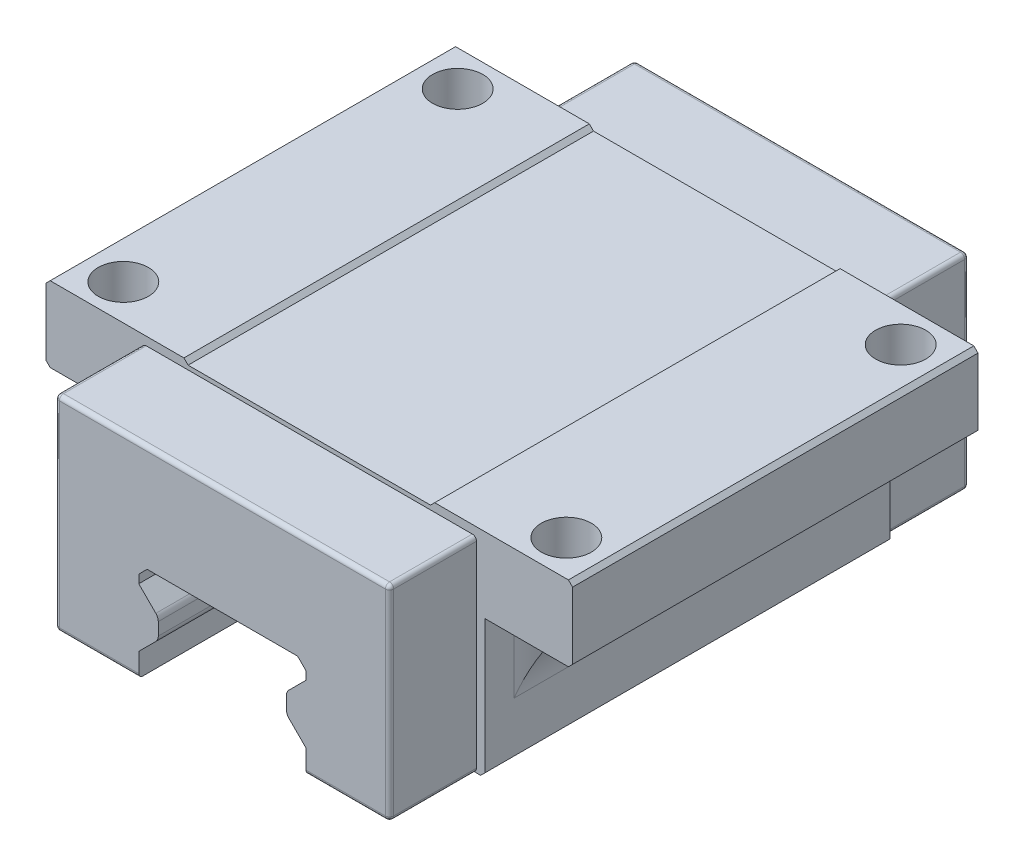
ISO-10303-21;
HEADER;
FILE_DESCRIPTION(('STEP AP214'),'2;1');
FILE_NAME('part.step','',(''),(''),'','','');
FILE_SCHEMA(('AUTOMOTIVE_DESIGN { 1 0 10303 214 1 1 1 1 }'));
ENDSEC;
DATA;
#1=APPLICATION_CONTEXT('core data for automotive mechanical design processes');
#2=APPLICATION_PROTOCOL_DEFINITION('international standard','automotive_design',2000,#1);
#3=PRODUCT_CONTEXT('',#1,'mechanical');
#4=PRODUCT('Part','Part','',(#3));
#5=PRODUCT_RELATED_PRODUCT_CATEGORY('part','',(#4));
#6=PRODUCT_DEFINITION_FORMATION('','',#4);
#7=PRODUCT_DEFINITION_CONTEXT('part definition',#1,'design');
#8=PRODUCT_DEFINITION('design','',#6,#7);
#9=PRODUCT_DEFINITION_SHAPE('','',#8);
#10=(LENGTH_UNIT() NAMED_UNIT(*) SI_UNIT(.MILLI.,.METRE.));
#11=(NAMED_UNIT(*) PLANE_ANGLE_UNIT() SI_UNIT($,.RADIAN.));
#12=(NAMED_UNIT(*) SI_UNIT($,.STERADIAN.) SOLID_ANGLE_UNIT());
#13=UNCERTAINTY_MEASURE_WITH_UNIT(LENGTH_MEASURE(1.E-05),#10,'distance_accuracy_value','');
#14=(GEOMETRIC_REPRESENTATION_CONTEXT(3) GLOBAL_UNCERTAINTY_ASSIGNED_CONTEXT((#13)) GLOBAL_UNIT_ASSIGNED_CONTEXT((#10,
#11,#12)) REPRESENTATION_CONTEXT('',''));
#15=CARTESIAN_POINT('',(0.,0.,0.));
#16=DIRECTION('',(0.,0.,1.));
#17=DIRECTION('',(1.,0.,0.));
#18=AXIS2_PLACEMENT_3D('',#15,#16,#17);
#19=CARTESIAN_POINT('',(31.5,21.,15.75));
#20=DIRECTION('',(0.,1.,0.));
#21=DIRECTION('',(0.,0.,1.));
#22=AXIS2_PLACEMENT_3D('',#19,#20,#21);
#23=PLANE('',#22);
#24=CARTESIAN_POINT('',(26.5,21.,-20.));
#25=DIRECTION('',(0.,-1.,0.));
#26=DIRECTION('',(-1.,0.,0.));
#27=AXIS2_PLACEMENT_3D('',#24,#25,#26);
#28=CIRCLE('',#27,3.);
#29=CARTESIAN_POINT('',(23.5,21.,-20.));
#30=VERTEX_POINT('',#29);
#31=EDGE_CURVE('E1692',#30,#30,#28,.T.);
#32=ORIENTED_EDGE('',*,*,#31,.F.);
#33=EDGE_LOOP('',(#32));
#34=FACE_BOUND('',#33,.T.);
#35=DIRECTION('',(-1.,0.,0.));
#36=VECTOR('',#35,1.);
#37=CARTESIAN_POINT('',(31.,21.,-15.75));
#38=LINE('',#37,#36);
#39=CARTESIAN_POINT('',(31.,21.,-15.75));
#40=VERTEX_POINT('',#39);
#41=CARTESIAN_POINT('',(26.,21.,-15.75));
#42=VERTEX_POINT('',#41);
#43=EDGE_CURVE('E1637',#40,#42,#38,.T.);
#44=ORIENTED_EDGE('',*,*,#43,.T.);
#45=CARTESIAN_POINT('',(26.,21.,-20.75));
#46=DIRECTION('',(0.,1.,0.));
#47=DIRECTION('',(0.,0.,1.));
#48=AXIS2_PLACEMENT_3D('',#45,#46,#47);
#49=CIRCLE('',#48,5.);
#50=CARTESIAN_POINT('',(21.,21.,-20.75));
#51=VERTEX_POINT('',#50);
#52=EDGE_CURVE('E477',#42,#51,#49,.F.);
#53=ORIENTED_EDGE('',*,*,#52,.T.);
#54=DIRECTION('',(0.,0.,-1.));
#55=VECTOR('',#54,1.);
#56=CARTESIAN_POINT('',(21.,21.,24.25));
#57=LINE('',#56,#55);
#58=CARTESIAN_POINT('',(21.,21.,-24.25));
#59=VERTEX_POINT('',#58);
#60=EDGE_CURVE('E471',#51,#59,#57,.T.);
#61=ORIENTED_EDGE('',*,*,#60,.T.);
#62=DIRECTION('',(1.,0.,0.));
#63=VECTOR('',#62,1.);
#64=CARTESIAN_POINT('',(31.5,21.,-24.25));
#65=LINE('',#64,#63);
#66=CARTESIAN_POINT('',(31.,21.,-24.25));
#67=VERTEX_POINT('',#66);
#68=EDGE_CURVE('E475',#59,#67,#65,.T.);
#69=ORIENTED_EDGE('',*,*,#68,.T.);
#70=DIRECTION('',(0.,0.,1.));
#71=VECTOR('',#70,1.);
#72=CARTESIAN_POINT('',(31.,21.,15.75));
#73=LINE('',#72,#71);
#74=EDGE_CURVE('E976',#67,#40,#73,.T.);
#75=ORIENTED_EDGE('',*,*,#74,.T.);
#76=EDGE_LOOP('',(#44,#53,#61,#69,#75));
#77=FACE_BOUND('',#76,.T.);
#78=ADVANCED_FACE('F39',(#34,#77),#23,.F.);
#79=CARTESIAN_POINT('',(-31.5,21.,15.75));
#80=DIRECTION('',(0.,1.,0.));
#81=DIRECTION('',(0.,0.,1.));
#82=AXIS2_PLACEMENT_3D('',#79,#80,#81);
#83=PLANE('',#82);
#84=CARTESIAN_POINT('',(-26.5,21.,20.));
#85=DIRECTION('',(0.,1.,0.));
#86=DIRECTION('',(-1.,0.,0.));
#87=AXIS2_PLACEMENT_3D('',#84,#85,#86);
#88=CIRCLE('',#87,3.);
#89=CARTESIAN_POINT('',(-29.5,21.,20.));
#90=VERTEX_POINT('',#89);
#91=EDGE_CURVE('E495',#90,#90,#88,.T.);
#92=ORIENTED_EDGE('',*,*,#91,.T.);
#93=EDGE_LOOP('',(#92));
#94=FACE_BOUND('',#93,.T.);
#95=DIRECTION('',(1.,0.,0.));
#96=VECTOR('',#95,1.);
#97=CARTESIAN_POINT('',(-31.,21.,15.75));
#98=LINE('',#97,#96);
#99=CARTESIAN_POINT('',(-31.,21.,15.75));
#100=VERTEX_POINT('',#99);
#101=CARTESIAN_POINT('',(-26.,21.,15.75));
#102=VERTEX_POINT('',#101);
#103=EDGE_CURVE('E1358',#100,#102,#98,.T.);
#104=ORIENTED_EDGE('',*,*,#103,.T.);
#105=CARTESIAN_POINT('',(-26.,21.,20.75));
#106=DIRECTION('',(0.,1.,0.));
#107=DIRECTION('',(0.,0.,1.));
#108=AXIS2_PLACEMENT_3D('',#105,#106,#107);
#109=CIRCLE('',#108,5.);
#110=CARTESIAN_POINT('',(-21.,21.,20.75));
#111=VERTEX_POINT('',#110);
#112=EDGE_CURVE('E987',#102,#111,#109,.F.);
#113=ORIENTED_EDGE('',*,*,#112,.T.);
#114=DIRECTION('',(0.,0.,1.));
#115=VECTOR('',#114,1.);
#116=CARTESIAN_POINT('',(-21.,21.,24.25));
#117=LINE('',#116,#115);
#118=CARTESIAN_POINT('',(-21.,21.,24.25));
#119=VERTEX_POINT('',#118);
#120=EDGE_CURVE('E1362',#111,#119,#117,.T.);
#121=ORIENTED_EDGE('',*,*,#120,.T.);
#122=DIRECTION('',(1.,0.,0.));
#123=VECTOR('',#122,1.);
#124=CARTESIAN_POINT('',(-31.5,21.,24.25));
#125=LINE('',#124,#123);
#126=CARTESIAN_POINT('',(-31.,21.,24.25));
#127=VERTEX_POINT('',#126);
#128=EDGE_CURVE('E1344',#127,#119,#125,.T.);
#129=ORIENTED_EDGE('',*,*,#128,.F.);
#130=DIRECTION('',(0.,0.,-1.));
#131=VECTOR('',#130,1.);
#132=CARTESIAN_POINT('',(-31.,21.,15.75));
#133=LINE('',#132,#131);
#134=EDGE_CURVE('E929',#127,#100,#133,.T.);
#135=ORIENTED_EDGE('',*,*,#134,.T.);
#136=EDGE_LOOP('',(#104,#113,#121,#129,#135));
#137=FACE_BOUND('',#136,.T.);
#138=ADVANCED_FACE('F1051',(#94,#137),#83,.F.);
#139=CARTESIAN_POINT('',(21.,4.5,24.25));
#140=DIRECTION('',(-1.,0.,0.));
#141=DIRECTION('',(0.,0.,1.));
#142=AXIS2_PLACEMENT_3D('',#139,#140,#141);
#143=PLANE('',#142);
#144=ORIENTED_EDGE('',*,*,#60,.F.);
#145=DIRECTION('',(0.,1.,0.));
#146=VECTOR('',#145,1.);
#147=CARTESIAN_POINT('',(21.,11.,-20.75));
#148=LINE('',#147,#146);
#149=CARTESIAN_POINT('',(21.,11.,-20.75));
#150=VERTEX_POINT('',#149);
#151=EDGE_CURVE('E1013',#51,#150,#148,.F.);
#152=ORIENTED_EDGE('',*,*,#151,.T.);
#153=DIRECTION('',(0.,0.,-1.));
#154=VECTOR('',#153,1.);
#155=CARTESIAN_POINT('',(21.,11.,15.75));
#156=LINE('',#155,#154);
#157=CARTESIAN_POINT('',(21.,11.,20.75));
#158=VERTEX_POINT('',#157);
#159=EDGE_CURVE('E1369',#158,#150,#156,.T.);
#160=ORIENTED_EDGE('',*,*,#159,.F.);
#161=DIRECTION('',(0.,1.,0.));
#162=VECTOR('',#161,1.);
#163=CARTESIAN_POINT('',(21.,4.5,20.75));
#164=LINE('',#163,#162);
#165=CARTESIAN_POINT('',(21.,21.,20.75));
#166=VERTEX_POINT('',#165);
#167=EDGE_CURVE('E1009',#158,#166,#164,.T.);
#168=ORIENTED_EDGE('',*,*,#167,.T.);
#169=CARTESIAN_POINT('',(21.,21.,24.25));
#170=VERTEX_POINT('',#169);
#171=EDGE_CURVE('E483',#170,#166,#57,.T.);
#172=ORIENTED_EDGE('',*,*,#171,.F.);
#173=DIRECTION('',(0.,1.,0.));
#174=VECTOR('',#173,1.);
#175=CARTESIAN_POINT('',(21.,4.5,24.25));
#176=LINE('',#175,#174);
#177=CARTESIAN_POINT('',(21.,5.00000000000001,24.25));
#178=VERTEX_POINT('',#177);
#179=EDGE_CURVE('E527',#178,#170,#176,.T.);
#180=ORIENTED_EDGE('',*,*,#179,.F.);
#181=DIRECTION('',(0.,0.,-1.));
#182=VECTOR('',#181,1.);
#183=CARTESIAN_POINT('',(21.,5.00000000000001,24.25));
#184=LINE('',#183,#182);
#185=CARTESIAN_POINT('',(21.,5.00000000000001,-24.25));
#186=VERTEX_POINT('',#185);
#187=EDGE_CURVE('E501',#178,#186,#184,.T.);
#188=ORIENTED_EDGE('',*,*,#187,.T.);
#189=DIRECTION('',(0.,1.,0.));
#190=VECTOR('',#189,1.);
#191=CARTESIAN_POINT('',(21.,4.5,-24.25));
#192=LINE('',#191,#190);
#193=EDGE_CURVE('E490',#186,#59,#192,.T.);
#194=ORIENTED_EDGE('',*,*,#193,.T.);
#195=EDGE_LOOP('',(#144,#152,#160,#168,#172,#180,#188,#194));
#196=FACE_BOUND('',#195,.T.);
#197=ADVANCED_FACE('F498',(#196),#143,.F.);
#198=CARTESIAN_POINT('',(31.,11.,15.75));
#199=DIRECTION('',(0.,0.,1.));
#200=DIRECTION('',(1.,0.,0.));
#201=AXIS2_PLACEMENT_3D('',#198,#199,#200);
#202=PLANE('',#201);
#203=DIRECTION('',(-1.,0.,0.));
#204=VECTOR('',#203,1.);
#205=CARTESIAN_POINT('',(31.,21.,15.75));
#206=LINE('',#205,#204);
#207=CARTESIAN_POINT('',(31.,21.,15.75));
#208=VERTEX_POINT('',#207);
#209=CARTESIAN_POINT('',(26.,21.,15.75));
#210=VERTEX_POINT('',#209);
#211=EDGE_CURVE('E484',#208,#210,#206,.T.);
#212=ORIENTED_EDGE('',*,*,#211,.T.);
#213=DIRECTION('',(0.,1.,0.));
#214=VECTOR('',#213,1.);
#215=CARTESIAN_POINT('',(26.,11.,15.75));
#216=LINE('',#215,#214);
#217=CARTESIAN_POINT('',(26.,19.6602540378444,15.75));
#218=VERTEX_POINT('',#217);
#219=EDGE_CURVE('E60',#210,#218,#216,.F.);
#220=ORIENTED_EDGE('',*,*,#219,.T.);
#221=CARTESIAN_POINT('',(31.,11.,15.75));
#222=DIRECTION('',(0.,0.,-1.));
#223=DIRECTION('',(1.,0.,0.));
#224=AXIS2_PLACEMENT_3D('',#221,#222,#223);
#225=CIRCLE('',#224,10.);
#226=EDGE_CURVE('E1366',#218,#208,#225,.T.);
#227=ORIENTED_EDGE('',*,*,#226,.T.);
#228=EDGE_LOOP('',(#212,#220,#227));
#229=FACE_BOUND('',#228,.T.);
#230=ADVANCED_FACE('F1148',(#229),#202,.T.);
#231=CARTESIAN_POINT('',(31.,11.,-15.75));
#232=DIRECTION('',(0.,0.,1.));
#233=DIRECTION('',(1.,0.,0.));
#234=AXIS2_PLACEMENT_3D('',#231,#232,#233);
#235=PLANE('',#234);
#236=CARTESIAN_POINT('',(31.,11.,-15.75));
#237=DIRECTION('',(0.,0.,-1.));
#238=DIRECTION('',(1.,0.,0.));
#239=AXIS2_PLACEMENT_3D('',#236,#237,#238);
#240=CIRCLE('',#239,10.);
#241=CARTESIAN_POINT('',(26.,19.6602540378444,-15.75));
#242=VERTEX_POINT('',#241);
#243=EDGE_CURVE('E1370',#242,#40,#240,.T.);
#244=ORIENTED_EDGE('',*,*,#243,.F.);
#245=DIRECTION('',(0.,1.,0.));
#246=VECTOR('',#245,1.);
#247=CARTESIAN_POINT('',(26.,21.,-15.75));
#248=LINE('',#247,#246);
#249=EDGE_CURVE('E1003',#242,#42,#248,.T.);
#250=ORIENTED_EDGE('',*,*,#249,.T.);
#251=ORIENTED_EDGE('',*,*,#43,.F.);
#252=EDGE_LOOP('',(#244,#250,#251));
#253=FACE_BOUND('',#252,.T.);
#254=ADVANCED_FACE('F1140',(#253),#235,.F.);
#255=CARTESIAN_POINT('',(-21.,4.5,24.25));
#256=DIRECTION('',(1.,0.,0.));
#257=DIRECTION('',(0.,0.,-1.));
#258=AXIS2_PLACEMENT_3D('',#255,#256,#257);
#259=PLANE('',#258);
#260=ORIENTED_EDGE('',*,*,#120,.F.);
#261=DIRECTION('',(0.,1.,0.));
#262=VECTOR('',#261,1.);
#263=CARTESIAN_POINT('',(-21.,11.,20.75));
#264=LINE('',#263,#262);
#265=CARTESIAN_POINT('',(-21.,11.,20.75));
#266=VERTEX_POINT('',#265);
#267=EDGE_CURVE('E994',#111,#266,#264,.F.);
#268=ORIENTED_EDGE('',*,*,#267,.T.);
#269=DIRECTION('',(0.,0.,-1.));
#270=VECTOR('',#269,1.);
#271=CARTESIAN_POINT('',(-21.,11.,15.75));
#272=LINE('',#271,#270);
#273=CARTESIAN_POINT('',(-21.,11.,-20.75));
#274=VERTEX_POINT('',#273);
#275=EDGE_CURVE('E1384',#266,#274,#272,.T.);
#276=ORIENTED_EDGE('',*,*,#275,.T.);
#277=DIRECTION('',(0.,1.,0.));
#278=VECTOR('',#277,1.);
#279=CARTESIAN_POINT('',(-21.,4.5,-20.75));
#280=LINE('',#279,#278);
#281=CARTESIAN_POINT('',(-21.,21.,-20.75));
#282=VERTEX_POINT('',#281);
#283=EDGE_CURVE('E990',#274,#282,#280,.T.);
#284=ORIENTED_EDGE('',*,*,#283,.T.);
#285=CARTESIAN_POINT('',(-21.,21.,-24.25));
#286=VERTEX_POINT('',#285);
#287=EDGE_CURVE('E1365',#286,#282,#117,.T.);
#288=ORIENTED_EDGE('',*,*,#287,.F.);
#289=DIRECTION('',(0.,-1.,0.));
#290=VECTOR('',#289,1.);
#291=CARTESIAN_POINT('',(-21.,4.5,-24.25));
#292=LINE('',#291,#290);
#293=CARTESIAN_POINT('',(-21.,5.,-24.25));
#294=VERTEX_POINT('',#293);
#295=EDGE_CURVE('E520',#286,#294,#292,.T.);
#296=ORIENTED_EDGE('',*,*,#295,.T.);
#297=DIRECTION('',(0.,0.,1.));
#298=VECTOR('',#297,1.);
#299=CARTESIAN_POINT('',(-21.,5.,24.25));
#300=LINE('',#299,#298);
#301=CARTESIAN_POINT('',(-21.,5.,24.25));
#302=VERTEX_POINT('',#301);
#303=EDGE_CURVE('E654',#294,#302,#300,.T.);
#304=ORIENTED_EDGE('',*,*,#303,.T.);
#305=DIRECTION('',(0.,-1.,0.));
#306=VECTOR('',#305,1.);
#307=CARTESIAN_POINT('',(-21.,4.5,24.25));
#308=LINE('',#307,#306);
#309=EDGE_CURVE('E1499',#119,#302,#308,.T.);
#310=ORIENTED_EDGE('',*,*,#309,.F.);
#311=EDGE_LOOP('',(#260,#268,#276,#284,#288,#296,#304,#310));
#312=FACE_BOUND('',#311,.T.);
#313=ADVANCED_FACE('F1136',(#312),#259,.F.);
#314=CARTESIAN_POINT('',(-31.,11.,15.75));
#315=DIRECTION('',(0.,0.,-1.));
#316=DIRECTION('',(-1.,0.,0.));
#317=AXIS2_PLACEMENT_3D('',#314,#315,#316);
#318=PLANE('',#317);
#319=CARTESIAN_POINT('',(-31.,11.,15.75));
#320=DIRECTION('',(0.,0.,-1.));
#321=DIRECTION('',(-1.,0.,0.));
#322=AXIS2_PLACEMENT_3D('',#319,#320,#321);
#323=CIRCLE('',#322,10.);
#324=CARTESIAN_POINT('',(-26.,19.6602540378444,15.75));
#325=VERTEX_POINT('',#324);
#326=EDGE_CURVE('E1380',#100,#325,#323,.T.);
#327=ORIENTED_EDGE('',*,*,#326,.T.);
#328=DIRECTION('',(0.,1.,0.));
#329=VECTOR('',#328,1.);
#330=CARTESIAN_POINT('',(-26.,21.,15.75));
#331=LINE('',#330,#329);
#332=EDGE_CURVE('E983',#325,#102,#331,.T.);
#333=ORIENTED_EDGE('',*,*,#332,.T.);
#334=ORIENTED_EDGE('',*,*,#103,.F.);
#335=EDGE_LOOP('',(#327,#333,#334));
#336=FACE_BOUND('',#335,.T.);
#337=ADVANCED_FACE('F1139',(#336),#318,.F.);
#338=CARTESIAN_POINT('',(-31.,11.,-15.75));
#339=DIRECTION('',(0.,0.,-1.));
#340=DIRECTION('',(-1.,0.,0.));
#341=AXIS2_PLACEMENT_3D('',#338,#339,#340);
#342=PLANE('',#341);
#343=DIRECTION('',(1.,0.,0.));
#344=VECTOR('',#343,1.);
#345=CARTESIAN_POINT('',(-31.,21.,-15.75));
#346=LINE('',#345,#344);
#347=CARTESIAN_POINT('',(-31.,21.,-15.75));
#348=VERTEX_POINT('',#347);
#349=CARTESIAN_POINT('',(-26.,21.,-15.75));
#350=VERTEX_POINT('',#349);
#351=EDGE_CURVE('E1350',#348,#350,#346,.T.);
#352=ORIENTED_EDGE('',*,*,#351,.T.);
#353=DIRECTION('',(0.,1.,0.));
#354=VECTOR('',#353,1.);
#355=CARTESIAN_POINT('',(-26.,11.,-15.75));
#356=LINE('',#355,#354);
#357=CARTESIAN_POINT('',(-26.,19.6602540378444,-15.75));
#358=VERTEX_POINT('',#357);
#359=EDGE_CURVE('E1001',#350,#358,#356,.F.);
#360=ORIENTED_EDGE('',*,*,#359,.T.);
#361=CARTESIAN_POINT('',(-31.,11.,-15.75));
#362=DIRECTION('',(0.,0.,-1.));
#363=DIRECTION('',(-1.,0.,0.));
#364=AXIS2_PLACEMENT_3D('',#361,#362,#363);
#365=CIRCLE('',#364,10.);
#366=EDGE_CURVE('E1379',#348,#358,#365,.T.);
#367=ORIENTED_EDGE('',*,*,#366,.F.);
#368=EDGE_LOOP('',(#352,#360,#367));
#369=FACE_BOUND('',#368,.T.);
#370=ADVANCED_FACE('F1044',(#369),#342,.T.);
#371=CARTESIAN_POINT('',(-21.,30.,24.25));
#372=DIRECTION('',(0.,-1.,0.));
#373=DIRECTION('',(1.,0.,0.));
#374=AXIS2_PLACEMENT_3D('',#371,#372,#373);
#375=PLANE('',#374);
#376=CARTESIAN_POINT('',(-26.5,30.,-20.));
#377=DIRECTION('',(0.,-1.,0.));
#378=DIRECTION('',(-1.,0.,0.));
#379=AXIS2_PLACEMENT_3D('',#376,#377,#378);
#380=CIRCLE('',#379,3.);
#381=CARTESIAN_POINT('',(-29.5,30.,-20.));
#382=VERTEX_POINT('',#381);
#383=EDGE_CURVE('E1689',#382,#382,#380,.T.);
#384=ORIENTED_EDGE('',*,*,#383,.T.);
#385=EDGE_LOOP('',(#384));
#386=FACE_BOUND('',#385,.T.);
#387=CARTESIAN_POINT('',(-26.5,30.,20.));
#388=DIRECTION('',(0.,1.,0.));
#389=DIRECTION('',(-1.,0.,0.));
#390=AXIS2_PLACEMENT_3D('',#387,#388,#389);
#391=CIRCLE('',#390,3.);
#392=CARTESIAN_POINT('',(-29.5,30.,20.));
#393=VERTEX_POINT('',#392);
#394=EDGE_CURVE('E1706',#393,#393,#391,.T.);
#395=ORIENTED_EDGE('',*,*,#394,.F.);
#396=EDGE_LOOP('',(#395));
#397=FACE_BOUND('',#396,.T.);
#398=DIRECTION('',(-1.,0.,0.));
#399=VECTOR('',#398,1.);
#400=CARTESIAN_POINT('',(-21.,30.,-24.25));
#401=LINE('',#400,#399);
#402=CARTESIAN_POINT('',(-15.,30.,-24.25));
#403=VERTEX_POINT('',#402);
#404=CARTESIAN_POINT('',(-31.,30.,-24.25));
#405=VERTEX_POINT('',#404);
#406=EDGE_CURVE('E503',#403,#405,#401,.T.);
#407=ORIENTED_EDGE('',*,*,#406,.T.);
#408=DIRECTION('',(0.,0.,1.));
#409=VECTOR('',#408,1.);
#410=CARTESIAN_POINT('',(-31.,30.,24.25));
#411=LINE('',#410,#409);
#412=CARTESIAN_POINT('',(-31.,30.,24.25));
#413=VERTEX_POINT('',#412);
#414=EDGE_CURVE('E963',#405,#413,#411,.T.);
#415=ORIENTED_EDGE('',*,*,#414,.T.);
#416=DIRECTION('',(-1.,0.,0.));
#417=VECTOR('',#416,1.);
#418=CARTESIAN_POINT('',(-21.,30.,24.25));
#419=LINE('',#418,#417);
#420=CARTESIAN_POINT('',(-15.,30.,24.25));
#421=VERTEX_POINT('',#420);
#422=EDGE_CURVE('E1496',#421,#413,#419,.T.);
#423=ORIENTED_EDGE('',*,*,#422,.F.);
#424=DIRECTION('',(0.,0.,-1.));
#425=VECTOR('',#424,1.);
#426=CARTESIAN_POINT('',(-15.,30.,24.25));
#427=LINE('',#426,#425);
#428=EDGE_CURVE('E625',#421,#403,#427,.T.);
#429=ORIENTED_EDGE('',*,*,#428,.T.);
#430=EDGE_LOOP('',(#407,#415,#423,#429));
#431=FACE_BOUND('',#430,.T.);
#432=ADVANCED_FACE('F1145',(#386,#397,#431),#375,.F.);
#433=CARTESIAN_POINT('',(10.,16.3,-34.65));
#434=DIRECTION('',(1.,0.,0.));
#435=DIRECTION('',(0.,1.,0.));
#436=AXIS2_PLACEMENT_3D('',#433,#434,#435);
#437=PLANE('',#436);
#438=DIRECTION('',(0.,-1.,0.));
#439=VECTOR('',#438,1.);
#440=CARTESIAN_POINT('',(10.,0.,34.65));
#441=LINE('',#440,#439);
#442=CARTESIAN_POINT('',(10.,15.3,34.65));
#443=VERTEX_POINT('',#442);
#444=CARTESIAN_POINT('',(10.,14.3,34.65));
#445=VERTEX_POINT('',#444);
#446=EDGE_CURVE('E540',#443,#445,#441,.T.);
#447=ORIENTED_EDGE('',*,*,#446,.F.);
#448=DIRECTION('',(0.,0.,-1.));
#449=VECTOR('',#448,1.);
#450=CARTESIAN_POINT('',(10.,15.3,-34.65));
#451=LINE('',#450,#449);
#452=CARTESIAN_POINT('',(10.,15.3,-34.65));
#453=VERTEX_POINT('',#452);
#454=EDGE_CURVE('E550',#443,#453,#451,.T.);
#455=ORIENTED_EDGE('',*,*,#454,.T.);
#456=DIRECTION('',(0.,1.,0.));
#457=VECTOR('',#456,1.);
#458=CARTESIAN_POINT('',(10.,16.3,-34.65));
#459=LINE('',#458,#457);
#460=CARTESIAN_POINT('',(10.,14.3,-34.65));
#461=VERTEX_POINT('',#460);
#462=EDGE_CURVE('E1462',#461,#453,#459,.T.);
#463=ORIENTED_EDGE('',*,*,#462,.F.);
#464=DIRECTION('',(0.,0.,1.));
#465=VECTOR('',#464,1.);
#466=CARTESIAN_POINT('',(10.,14.3,-42.0286478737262));
#467=LINE('',#466,#465);
#468=EDGE_CURVE('E1401',#461,#445,#467,.T.);
#469=ORIENTED_EDGE('',*,*,#468,.T.);
#470=EDGE_LOOP('',(#447,#455,#463,#469));
#471=FACE_BOUND('',#470,.T.);
#472=ADVANCED_FACE('F1101',(#471),#437,.F.);
#473=CARTESIAN_POINT('',(-10.,16.3,-34.65));
#474=DIRECTION('',(-1.,0.,0.));
#475=DIRECTION('',(0.,-1.,0.));
#476=AXIS2_PLACEMENT_3D('',#473,#474,#475);
#477=PLANE('',#476);
#478=DIRECTION('',(0.,-1.,0.));
#479=VECTOR('',#478,1.);
#480=CARTESIAN_POINT('',(-10.,16.3,34.65));
#481=LINE('',#480,#479);
#482=CARTESIAN_POINT('',(-10.,7.3,34.65));
#483=VERTEX_POINT('',#482);
#484=CARTESIAN_POINT('',(-10.,5.,34.65));
#485=VERTEX_POINT('',#484);
#486=EDGE_CURVE('E1475',#483,#485,#481,.T.);
#487=ORIENTED_EDGE('',*,*,#486,.T.);
#488=CARTESIAN_POINT('',(-10.,5.,34.15));
#489=DIRECTION('',(-1.,0.,0.));
#490=DIRECTION('',(0.,-1.,0.));
#491=AXIS2_PLACEMENT_3D('',#488,#489,#490);
#492=CIRCLE('',#491,0.5);
#493=CARTESIAN_POINT('',(-10.,4.5,34.15));
#494=VERTEX_POINT('',#493);
#495=EDGE_CURVE('E763',#485,#494,#492,.F.);
#496=ORIENTED_EDGE('',*,*,#495,.T.);
#497=DIRECTION('',(0.,0.,1.));
#498=VECTOR('',#497,1.);
#499=CARTESIAN_POINT('',(-10.,4.5,24.25));
#500=LINE('',#499,#498);
#501=CARTESIAN_POINT('',(-10.,4.5,-34.15));
#502=VERTEX_POINT('',#501);
#503=EDGE_CURVE('E1471',#502,#494,#500,.T.);
#504=ORIENTED_EDGE('',*,*,#503,.F.);
#505=CARTESIAN_POINT('',(-10.,5.,-34.15));
#506=DIRECTION('',(-1.,0.,0.));
#507=DIRECTION('',(0.,-1.,0.));
#508=AXIS2_PLACEMENT_3D('',#505,#506,#507);
#509=CIRCLE('',#508,0.5);
#510=CARTESIAN_POINT('',(-10.,5.,-34.65));
#511=VERTEX_POINT('',#510);
#512=EDGE_CURVE('E760',#502,#511,#509,.F.);
#513=ORIENTED_EDGE('',*,*,#512,.T.);
#514=DIRECTION('',(0.,-1.,0.));
#515=VECTOR('',#514,1.);
#516=CARTESIAN_POINT('',(-10.,16.3,-34.65));
#517=LINE('',#516,#515);
#518=CARTESIAN_POINT('',(-10.,7.3,-34.65));
#519=VERTEX_POINT('',#518);
#520=EDGE_CURVE('E1466',#519,#511,#517,.T.);
#521=ORIENTED_EDGE('',*,*,#520,.F.);
#522=DIRECTION('',(0.,0.,1.));
#523=VECTOR('',#522,1.);
#524=CARTESIAN_POINT('',(-10.,7.3,-42.0286478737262));
#525=LINE('',#524,#523);
#526=EDGE_CURVE('E1432',#519,#483,#525,.T.);
#527=ORIENTED_EDGE('',*,*,#526,.T.);
#528=EDGE_LOOP('',(#487,#496,#504,#513,#521,#527));
#529=FACE_BOUND('',#528,.T.);
#530=ADVANCED_FACE('F1093',(#529),#477,.F.);
#531=CARTESIAN_POINT('',(-21.,4.5,24.25));
#532=DIRECTION('',(0.,1.,0.));
#533=DIRECTION('',(-1.,0.,0.));
#534=AXIS2_PLACEMENT_3D('',#531,#532,#533);
#535=PLANE('',#534);
#536=DIRECTION('',(0.,0.,-1.));
#537=VECTOR('',#536,1.);
#538=CARTESIAN_POINT('',(19.5,4.5,24.25));
#539=LINE('',#538,#537);
#540=CARTESIAN_POINT('',(19.5,4.5,24.25));
#541=VERTEX_POINT('',#540);
#542=CARTESIAN_POINT('',(19.5,4.5,34.15));
#543=VERTEX_POINT('',#542);
#544=EDGE_CURVE('E709',#541,#543,#539,.F.);
#545=ORIENTED_EDGE('',*,*,#544,.T.);
#546=DIRECTION('',(1.,0.,0.));
#547=VECTOR('',#546,1.);
#548=CARTESIAN_POINT('',(-21.,4.5,34.15));
#549=LINE('',#548,#547);
#550=CARTESIAN_POINT('',(10.,4.5,34.15));
#551=VERTEX_POINT('',#550);
#552=EDGE_CURVE('E712',#543,#551,#549,.F.);
#553=ORIENTED_EDGE('',*,*,#552,.T.);
#554=DIRECTION('',(0.,0.,-1.));
#555=VECTOR('',#554,1.);
#556=CARTESIAN_POINT('',(10.,4.5,24.25));
#557=LINE('',#556,#555);
#558=CARTESIAN_POINT('',(10.,4.5,-34.15));
#559=VERTEX_POINT('',#558);
#560=EDGE_CURVE('E1483',#551,#559,#557,.T.);
#561=ORIENTED_EDGE('',*,*,#560,.T.);
#562=DIRECTION('',(1.,0.,0.));
#563=VECTOR('',#562,1.);
#564=CARTESIAN_POINT('',(20.,4.5,-34.15));
#565=LINE('',#564,#563);
#566=CARTESIAN_POINT('',(19.5,4.5,-34.15));
#567=VERTEX_POINT('',#566);
#568=EDGE_CURVE('E706',#559,#567,#565,.T.);
#569=ORIENTED_EDGE('',*,*,#568,.T.);
#570=DIRECTION('',(0.,0.,-1.));
#571=VECTOR('',#570,1.);
#572=CARTESIAN_POINT('',(19.5,4.5,24.25));
#573=LINE('',#572,#571);
#574=CARTESIAN_POINT('',(19.5,4.5,-24.25));
#575=VERTEX_POINT('',#574);
#576=EDGE_CURVE('E702',#567,#575,#573,.F.);
#577=ORIENTED_EDGE('',*,*,#576,.T.);
#578=DIRECTION('',(1.,0.,0.));
#579=VECTOR('',#578,1.);
#580=CARTESIAN_POINT('',(-21.,4.5,-24.25));
#581=LINE('',#580,#579);
#582=CARTESIAN_POINT('',(20.5,4.5,-24.25));
#583=VERTEX_POINT('',#582);
#584=EDGE_CURVE('E523',#575,#583,#581,.T.);
#585=ORIENTED_EDGE('',*,*,#584,.T.);
#586=DIRECTION('',(0.,0.,1.));
#587=VECTOR('',#586,1.);
#588=CARTESIAN_POINT('',(20.5,4.5,24.25));
#589=LINE('',#588,#587);
#590=CARTESIAN_POINT('',(20.5,4.5,24.25));
#591=VERTEX_POINT('',#590);
#592=EDGE_CURVE('E647',#583,#591,#589,.T.);
#593=ORIENTED_EDGE('',*,*,#592,.T.);
#594=DIRECTION('',(1.,0.,0.));
#595=VECTOR('',#594,1.);
#596=CARTESIAN_POINT('',(-21.,4.5,24.25));
#597=LINE('',#596,#595);
#598=EDGE_CURVE('E1501',#541,#591,#597,.T.);
#599=ORIENTED_EDGE('',*,*,#598,.F.);
#600=EDGE_LOOP('',(#545,#553,#561,#569,#577,#585,#593,#599));
#601=FACE_BOUND('',#600,.T.);
#602=ADVANCED_FACE('F1128',(#601),#535,.F.);
#603=CARTESIAN_POINT('',(0.,0.,24.25));
#604=DIRECTION('',(0.,0.,-1.));
#605=DIRECTION('',(-1.,0.,0.));
#606=AXIS2_PLACEMENT_3D('',#603,#604,#605);
#607=PLANE('',#606);
#608=DIRECTION('',(0.,-1.,0.));
#609=VECTOR('',#608,1.);
#610=CARTESIAN_POINT('',(-31.5,21.,24.25));
#611=LINE('',#610,#609);
#612=CARTESIAN_POINT('',(-31.5,29.5,24.25));
#613=VERTEX_POINT('',#612);
#614=CARTESIAN_POINT('',(-31.5,21.5,24.25));
#615=VERTEX_POINT('',#614);
#616=EDGE_CURVE('E1347',#613,#615,#611,.T.);
#617=ORIENTED_EDGE('',*,*,#616,.T.);
#618=DIRECTION('',(-0.707106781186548,0.707106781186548,0.));
#619=VECTOR('',#618,1.);
#620=CARTESIAN_POINT('',(-31.,21.,24.25));
#621=LINE('',#620,#619);
#622=EDGE_CURVE('E960',#615,#127,#621,.F.);
#623=ORIENTED_EDGE('',*,*,#622,.T.);
#624=ORIENTED_EDGE('',*,*,#128,.T.);
#625=ORIENTED_EDGE('',*,*,#309,.T.);
#626=DIRECTION('',(-0.707106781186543,0.707106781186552,0.));
#627=VECTOR('',#626,1.);
#628=CARTESIAN_POINT('',(-20.5,4.5,24.25));
#629=LINE('',#628,#627);
#630=CARTESIAN_POINT('',(-20.5,4.5,24.25));
#631=VERTEX_POINT('',#630);
#632=EDGE_CURVE('E641',#302,#631,#629,.F.);
#633=ORIENTED_EDGE('',*,*,#632,.T.);
#634=CARTESIAN_POINT('',(-19.5,4.5,24.25));
#635=VERTEX_POINT('',#634);
#636=EDGE_CURVE('E516',#631,#635,#597,.T.);
#637=ORIENTED_EDGE('',*,*,#636,.T.);
#638=CARTESIAN_POINT('',(-19.5,5.,24.25));
#639=DIRECTION('',(0.,0.,-1.));
#640=DIRECTION('',(-1.,0.,0.));
#641=AXIS2_PLACEMENT_3D('',#638,#639,#640);
#642=CIRCLE('',#641,0.5);
#643=CARTESIAN_POINT('',(-20.,5.,24.25));
#644=VERTEX_POINT('',#643);
#645=EDGE_CURVE('E806',#635,#644,#642,.T.);
#646=ORIENTED_EDGE('',*,*,#645,.T.);
#647=DIRECTION('',(0.,-1.,0.));
#648=VECTOR('',#647,1.);
#649=CARTESIAN_POINT('',(-20.,0.,24.25));
#650=LINE('',#649,#648);
#651=CARTESIAN_POINT('',(-20.,28.5,24.25));
#652=VERTEX_POINT('',#651);
#653=EDGE_CURVE('E504',#652,#644,#650,.T.);
#654=ORIENTED_EDGE('',*,*,#653,.F.);
#655=CARTESIAN_POINT('',(-19.5,28.5,24.25));
#656=DIRECTION('',(0.,0.,-1.));
#657=DIRECTION('',(-1.,0.,0.));
#658=AXIS2_PLACEMENT_3D('',#655,#656,#657);
#659=CIRCLE('',#658,0.5);
#660=CARTESIAN_POINT('',(-19.5,29.,24.25));
#661=VERTEX_POINT('',#660);
#662=EDGE_CURVE('E814',#652,#661,#659,.T.);
#663=ORIENTED_EDGE('',*,*,#662,.T.);
#664=DIRECTION('',(-1.,0.,0.));
#665=VECTOR('',#664,1.);
#666=CARTESIAN_POINT('',(0.,29.,24.25));
#667=LINE('',#666,#665);
#668=CARTESIAN_POINT('',(19.5,29.,24.25));
#669=VERTEX_POINT('',#668);
#670=EDGE_CURVE('E1487',#669,#661,#667,.T.);
#671=ORIENTED_EDGE('',*,*,#670,.F.);
#672=CARTESIAN_POINT('',(19.5,28.5,24.25));
#673=DIRECTION('',(0.,0.,-1.));
#674=DIRECTION('',(-1.,0.,0.));
#675=AXIS2_PLACEMENT_3D('',#672,#673,#674);
#676=CIRCLE('',#675,0.5);
#677=CARTESIAN_POINT('',(20.,28.5,24.25));
#678=VERTEX_POINT('',#677);
#679=EDGE_CURVE('E817',#669,#678,#676,.T.);
#680=ORIENTED_EDGE('',*,*,#679,.T.);
#681=DIRECTION('',(0.,1.,0.));
#682=VECTOR('',#681,1.);
#683=CARTESIAN_POINT('',(20.,0.,24.25));
#684=LINE('',#683,#682);
#685=CARTESIAN_POINT('',(20.,5.,24.25));
#686=VERTEX_POINT('',#685);
#687=EDGE_CURVE('E513',#686,#678,#684,.T.);
#688=ORIENTED_EDGE('',*,*,#687,.F.);
#689=CARTESIAN_POINT('',(19.5,5.,24.25));
#690=DIRECTION('',(0.,0.,-1.));
#691=DIRECTION('',(-1.,0.,0.));
#692=AXIS2_PLACEMENT_3D('',#689,#690,#691);
#693=CIRCLE('',#692,0.5);
#694=EDGE_CURVE('E810',#686,#541,#693,.T.);
#695=ORIENTED_EDGE('',*,*,#694,.T.);
#696=ORIENTED_EDGE('',*,*,#598,.T.);
#697=DIRECTION('',(-0.707106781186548,-0.707106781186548,0.));
#698=VECTOR('',#697,1.);
#699=CARTESIAN_POINT('',(21.,5.00000000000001,24.25));
#700=LINE('',#699,#698);
#701=EDGE_CURVE('E644',#591,#178,#700,.F.);
#702=ORIENTED_EDGE('',*,*,#701,.T.);
#703=ORIENTED_EDGE('',*,*,#179,.T.);
#704=DIRECTION('',(1.,0.,0.));
#705=VECTOR('',#704,1.);
#706=CARTESIAN_POINT('',(31.5,21.,24.25));
#707=LINE('',#706,#705);
#708=CARTESIAN_POINT('',(31.,21.,24.25));
#709=VERTEX_POINT('',#708);
#710=EDGE_CURVE('E1333',#170,#709,#707,.T.);
#711=ORIENTED_EDGE('',*,*,#710,.T.);
#712=DIRECTION('',(-0.707106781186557,-0.707106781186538,0.));
#713=VECTOR('',#712,1.);
#714=CARTESIAN_POINT('',(31.5,21.5,24.25));
#715=LINE('',#714,#713);
#716=CARTESIAN_POINT('',(31.5,21.5,24.25));
#717=VERTEX_POINT('',#716);
#718=EDGE_CURVE('E954',#709,#717,#715,.F.);
#719=ORIENTED_EDGE('',*,*,#718,.T.);
#720=DIRECTION('',(0.,1.,0.));
#721=VECTOR('',#720,1.);
#722=CARTESIAN_POINT('',(31.5,21.,24.25));
#723=LINE('',#722,#721);
#724=CARTESIAN_POINT('',(31.5,29.5,24.25));
#725=VERTEX_POINT('',#724);
#726=EDGE_CURVE('E1634',#717,#725,#723,.T.);
#727=ORIENTED_EDGE('',*,*,#726,.T.);
#728=DIRECTION('',(0.707106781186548,-0.707106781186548,0.));
#729=VECTOR('',#728,1.);
#730=CARTESIAN_POINT('',(31.,30.,24.25));
#731=LINE('',#730,#729);
#732=CARTESIAN_POINT('',(31.,30.,24.25));
#733=VERTEX_POINT('',#732);
#734=EDGE_CURVE('E951',#725,#733,#731,.F.);
#735=ORIENTED_EDGE('',*,*,#734,.T.);
#736=CARTESIAN_POINT('',(15.,30.,24.25));
#737=VERTEX_POINT('',#736);
#738=EDGE_CURVE('E1497',#733,#737,#419,.T.);
#739=ORIENTED_EDGE('',*,*,#738,.T.);
#740=DIRECTION('',(0.707106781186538,0.707106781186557,0.));
#741=VECTOR('',#740,1.);
#742=CARTESIAN_POINT('',(-7.4999999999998,7.49999999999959,24.25));
#743=LINE('',#742,#741);
#744=CARTESIAN_POINT('',(14.5,29.5,24.25));
#745=VERTEX_POINT('',#744);
#746=EDGE_CURVE('E665',#737,#745,#743,.F.);
#747=ORIENTED_EDGE('',*,*,#746,.T.);
#748=DIRECTION('',(1.,0.,0.));
#749=VECTOR('',#748,1.);
#750=CARTESIAN_POINT('',(-15.,29.5,24.25));
#751=LINE('',#750,#749);
#752=CARTESIAN_POINT('',(-14.5,29.5,24.25));
#753=VERTEX_POINT('',#752);
#754=EDGE_CURVE('E878',#753,#745,#751,.T.);
#755=ORIENTED_EDGE('',*,*,#754,.F.);
#756=DIRECTION('',(0.707106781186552,-0.707106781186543,0.));
#757=VECTOR('',#756,1.);
#758=CARTESIAN_POINT('',(7.50000000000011,7.50000000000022,24.25));
#759=LINE('',#758,#757);
#760=EDGE_CURVE('E672',#753,#421,#759,.F.);
#761=ORIENTED_EDGE('',*,*,#760,.T.);
#762=ORIENTED_EDGE('',*,*,#422,.T.);
#763=DIRECTION('',(0.707106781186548,0.707106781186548,0.));
#764=VECTOR('',#763,1.);
#765=CARTESIAN_POINT('',(-31.5,29.5,24.25));
#766=LINE('',#765,#764);
#767=EDGE_CURVE('E957',#413,#613,#766,.F.);
#768=ORIENTED_EDGE('',*,*,#767,.T.);
#769=EDGE_LOOP('',(#617,#623,#624,#625,#633,#637,#646,#654,#663,#671,#680,#688,#695,#696,#702,
#703,#711,#719,#727,#735,#739,#747,#755,#761,#762,#768));
#770=FACE_BOUND('',#769,.T.);
#771=ADVANCED_FACE('F1125',(#770),#607,.F.);
#772=CARTESIAN_POINT('',(0.,0.,-24.25));
#773=DIRECTION('',(0.,0.,-1.));
#774=DIRECTION('',(-1.,0.,0.));
#775=AXIS2_PLACEMENT_3D('',#772,#773,#774);
#776=PLANE('',#775);
#777=DIRECTION('',(1.,0.,0.));
#778=VECTOR('',#777,1.);
#779=CARTESIAN_POINT('',(-31.5,21.,-24.25));
#780=LINE('',#779,#778);
#781=CARTESIAN_POINT('',(-31.,21.,-24.25));
#782=VERTEX_POINT('',#781);
#783=EDGE_CURVE('E1336',#782,#286,#780,.T.);
#784=ORIENTED_EDGE('',*,*,#783,.F.);
#785=DIRECTION('',(0.707106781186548,-0.707106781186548,0.));
#786=VECTOR('',#785,1.);
#787=CARTESIAN_POINT('',(-5.,-5.,-24.25));
#788=LINE('',#787,#786);
#789=CARTESIAN_POINT('',(-31.5,21.5,-24.25));
#790=VERTEX_POINT('',#789);
#791=EDGE_CURVE('E941',#782,#790,#788,.F.);
#792=ORIENTED_EDGE('',*,*,#791,.T.);
#793=DIRECTION('',(0.,-1.,0.));
#794=VECTOR('',#793,1.);
#795=CARTESIAN_POINT('',(-31.5,21.,-24.25));
#796=LINE('',#795,#794);
#797=CARTESIAN_POINT('',(-31.5,29.5,-24.25));
#798=VERTEX_POINT('',#797);
#799=EDGE_CURVE('E1339',#798,#790,#796,.T.);
#800=ORIENTED_EDGE('',*,*,#799,.F.);
#801=DIRECTION('',(-0.707106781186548,-0.707106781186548,0.));
#802=VECTOR('',#801,1.);
#803=CARTESIAN_POINT('',(-30.5,30.5,-24.25));
#804=LINE('',#803,#802);
#805=EDGE_CURVE('E938',#798,#405,#804,.F.);
#806=ORIENTED_EDGE('',*,*,#805,.T.);
#807=ORIENTED_EDGE('',*,*,#406,.F.);
#808=DIRECTION('',(-0.707106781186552,0.707106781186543,0.));
#809=VECTOR('',#808,1.);
#810=CARTESIAN_POINT('',(-14.5,29.5,-24.25));
#811=LINE('',#810,#809);
#812=CARTESIAN_POINT('',(-14.5,29.5,-24.25));
#813=VERTEX_POINT('',#812);
#814=EDGE_CURVE('E675',#403,#813,#811,.F.);
#815=ORIENTED_EDGE('',*,*,#814,.T.);
#816=DIRECTION('',(-1.,0.,0.));
#817=VECTOR('',#816,1.);
#818=CARTESIAN_POINT('',(0.,29.5,-24.25));
#819=LINE('',#818,#817);
#820=CARTESIAN_POINT('',(14.5,29.5,-24.25));
#821=VERTEX_POINT('',#820);
#822=EDGE_CURVE('E628',#821,#813,#819,.T.);
#823=ORIENTED_EDGE('',*,*,#822,.F.);
#824=DIRECTION('',(-0.707106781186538,-0.707106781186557,0.));
#825=VECTOR('',#824,1.);
#826=CARTESIAN_POINT('',(15.,30.,-24.25));
#827=LINE('',#826,#825);
#828=CARTESIAN_POINT('',(15.,30.,-24.25));
#829=VERTEX_POINT('',#828);
#830=EDGE_CURVE('E668',#821,#829,#827,.F.);
#831=ORIENTED_EDGE('',*,*,#830,.T.);
#832=CARTESIAN_POINT('',(31.,30.,-24.25));
#833=VERTEX_POINT('',#832);
#834=EDGE_CURVE('E510',#833,#829,#401,.T.);
#835=ORIENTED_EDGE('',*,*,#834,.F.);
#836=DIRECTION('',(-0.707106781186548,0.707106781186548,0.));
#837=VECTOR('',#836,1.);
#838=CARTESIAN_POINT('',(30.5,30.5,-24.25));
#839=LINE('',#838,#837);
#840=CARTESIAN_POINT('',(31.5,29.5,-24.25));
#841=VERTEX_POINT('',#840);
#842=EDGE_CURVE('E933',#833,#841,#839,.F.);
#843=ORIENTED_EDGE('',*,*,#842,.T.);
#844=DIRECTION('',(0.,1.,0.));
#845=VECTOR('',#844,1.);
#846=CARTESIAN_POINT('',(31.5,21.,-24.25));
#847=LINE('',#846,#845);
#848=CARTESIAN_POINT('',(31.5,21.5,-24.25));
#849=VERTEX_POINT('',#848);
#850=EDGE_CURVE('E494',#849,#841,#847,.T.);
#851=ORIENTED_EDGE('',*,*,#850,.F.);
#852=DIRECTION('',(0.707106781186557,0.707106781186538,0.));
#853=VECTOR('',#852,1.);
#854=CARTESIAN_POINT('',(4.99999999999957,-4.99999999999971,-24.25));
#855=LINE('',#854,#853);
#856=EDGE_CURVE('E492',#849,#67,#855,.F.);
#857=ORIENTED_EDGE('',*,*,#856,.T.);
#858=ORIENTED_EDGE('',*,*,#68,.F.);
#859=ORIENTED_EDGE('',*,*,#193,.F.);
#860=DIRECTION('',(0.707106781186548,0.707106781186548,0.));
#861=VECTOR('',#860,1.);
#862=CARTESIAN_POINT('',(8.,-8.,-24.25));
#863=LINE('',#862,#861);
#864=EDGE_CURVE('E636',#186,#583,#863,.F.);
#865=ORIENTED_EDGE('',*,*,#864,.T.);
#866=ORIENTED_EDGE('',*,*,#584,.F.);
#867=CARTESIAN_POINT('',(19.5,5.,-24.25));
#868=DIRECTION('',(0.,0.,-1.));
#869=DIRECTION('',(-1.,0.,0.));
#870=AXIS2_PLACEMENT_3D('',#867,#868,#869);
#871=CIRCLE('',#870,0.5);
#872=CARTESIAN_POINT('',(20.,5.,-24.25));
#873=VERTEX_POINT('',#872);
#874=EDGE_CURVE('E820',#575,#873,#871,.F.);
#875=ORIENTED_EDGE('',*,*,#874,.T.);
#876=DIRECTION('',(0.,1.,0.));
#877=VECTOR('',#876,1.);
#878=CARTESIAN_POINT('',(20.,0.,-24.25));
#879=LINE('',#878,#877);
#880=CARTESIAN_POINT('',(20.,28.5,-24.25));
#881=VERTEX_POINT('',#880);
#882=EDGE_CURVE('E532',#873,#881,#879,.T.);
#883=ORIENTED_EDGE('',*,*,#882,.T.);
#884=CARTESIAN_POINT('',(19.5,28.5,-24.25));
#885=DIRECTION('',(0.,0.,-1.));
#886=DIRECTION('',(-1.,0.,0.));
#887=AXIS2_PLACEMENT_3D('',#884,#885,#886);
#888=CIRCLE('',#887,0.5);
#889=CARTESIAN_POINT('',(19.5,29.,-24.25));
#890=VERTEX_POINT('',#889);
#891=EDGE_CURVE('E823',#881,#890,#888,.F.);
#892=ORIENTED_EDGE('',*,*,#891,.T.);
#893=DIRECTION('',(-1.,0.,0.));
#894=VECTOR('',#893,1.);
#895=CARTESIAN_POINT('',(0.,29.,-24.25));
#896=LINE('',#895,#894);
#897=CARTESIAN_POINT('',(-19.5,29.,-24.25));
#898=VERTEX_POINT('',#897);
#899=EDGE_CURVE('E528',#890,#898,#896,.T.);
#900=ORIENTED_EDGE('',*,*,#899,.T.);
#901=CARTESIAN_POINT('',(-19.5,28.5,-24.25));
#902=DIRECTION('',(0.,0.,-1.));
#903=DIRECTION('',(-1.,0.,0.));
#904=AXIS2_PLACEMENT_3D('',#901,#902,#903);
#905=CIRCLE('',#904,0.5);
#906=CARTESIAN_POINT('',(-20.,28.5,-24.25));
#907=VERTEX_POINT('',#906);
#908=EDGE_CURVE('E826',#898,#907,#905,.F.);
#909=ORIENTED_EDGE('',*,*,#908,.T.);
#910=DIRECTION('',(0.,-1.,0.));
#911=VECTOR('',#910,1.);
#912=CARTESIAN_POINT('',(-20.,0.,-24.25));
#913=LINE('',#912,#911);
#914=CARTESIAN_POINT('',(-20.,5.,-24.25));
#915=VERTEX_POINT('',#914);
#916=EDGE_CURVE('E536',#907,#915,#913,.T.);
#917=ORIENTED_EDGE('',*,*,#916,.T.);
#918=CARTESIAN_POINT('',(-19.5,5.,-24.25));
#919=DIRECTION('',(0.,0.,-1.));
#920=DIRECTION('',(-1.,0.,0.));
#921=AXIS2_PLACEMENT_3D('',#918,#919,#920);
#922=CIRCLE('',#921,0.5);
#923=CARTESIAN_POINT('',(-19.5,4.5,-24.25));
#924=VERTEX_POINT('',#923);
#925=EDGE_CURVE('E802',#915,#924,#922,.F.);
#926=ORIENTED_EDGE('',*,*,#925,.T.);
#927=CARTESIAN_POINT('',(-20.5,4.5,-24.25));
#928=VERTEX_POINT('',#927);
#929=EDGE_CURVE('E524',#928,#924,#581,.T.);
#930=ORIENTED_EDGE('',*,*,#929,.F.);
#931=DIRECTION('',(0.707106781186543,-0.707106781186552,0.));
#932=VECTOR('',#931,1.);
#933=CARTESIAN_POINT('',(-8.00000000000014,-8.00000000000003,-24.25));
#934=LINE('',#933,#932);
#935=EDGE_CURVE('E632',#928,#294,#934,.F.);
#936=ORIENTED_EDGE('',*,*,#935,.T.);
#937=ORIENTED_EDGE('',*,*,#295,.F.);
#938=EDGE_LOOP('',(#784,#792,#800,#806,#807,#815,#823,#831,#835,#843,#851,#857,#858,#859,#865,
#866,#875,#883,#892,#900,#909,#917,#926,#930,#936,#937));
#939=FACE_BOUND('',#938,.T.);
#940=ADVANCED_FACE('F489',(#939),#776,.T.);
#941=CARTESIAN_POINT('',(26.5,30.,-20.));
#942=DIRECTION('',(0.,-1.,0.));
#943=DIRECTION('',(-1.,0.,0.));
#944=AXIS2_PLACEMENT_3D('',#941,#942,#943);
#945=CIRCLE('',#944,3.);
#946=CARTESIAN_POINT('',(23.5,30.,-20.));
#947=VERTEX_POINT('',#946);
#948=EDGE_CURVE('E1695',#947,#947,#945,.T.);
#949=ORIENTED_EDGE('',*,*,#948,.T.);
#950=EDGE_LOOP('',(#949));
#951=FACE_BOUND('',#950,.T.);
#952=CARTESIAN_POINT('',(26.5,30.,20.));
#953=DIRECTION('',(0.,1.,0.));
#954=DIRECTION('',(-1.,0.,0.));
#955=AXIS2_PLACEMENT_3D('',#952,#953,#954);
#956=CIRCLE('',#955,3.);
#957=CARTESIAN_POINT('',(23.5,30.,20.));
#958=VERTEX_POINT('',#957);
#959=EDGE_CURVE('E1711',#958,#958,#956,.T.);
#960=ORIENTED_EDGE('',*,*,#959,.F.);
#961=EDGE_LOOP('',(#960));
#962=FACE_BOUND('',#961,.T.);
#963=ORIENTED_EDGE('',*,*,#738,.F.);
#964=DIRECTION('',(0.,0.,-1.));
#965=VECTOR('',#964,1.);
#966=CARTESIAN_POINT('',(31.,30.,24.25));
#967=LINE('',#966,#965);
#968=EDGE_CURVE('E979',#733,#833,#967,.T.);
#969=ORIENTED_EDGE('',*,*,#968,.T.);
#970=ORIENTED_EDGE('',*,*,#834,.T.);
#971=DIRECTION('',(0.,0.,1.));
#972=VECTOR('',#971,1.);
#973=CARTESIAN_POINT('',(15.,30.,24.25));
#974=LINE('',#973,#972);
#975=EDGE_CURVE('E621',#829,#737,#974,.T.);
#976=ORIENTED_EDGE('',*,*,#975,.T.);
#977=EDGE_LOOP('',(#963,#969,#970,#976));
#978=FACE_BOUND('',#977,.T.);
#979=ADVANCED_FACE('F1132',(#951,#962,#978),#375,.F.);
#980=DIRECTION('',(0.,0.,-1.));
#981=VECTOR('',#980,1.);
#982=CARTESIAN_POINT('',(-19.5,4.5,24.25));
#983=LINE('',#982,#981);
#984=CARTESIAN_POINT('',(-19.5,4.5,34.15));
#985=VERTEX_POINT('',#984);
#986=EDGE_CURVE('E688',#985,#635,#983,.T.);
#987=ORIENTED_EDGE('',*,*,#986,.T.);
#988=ORIENTED_EDGE('',*,*,#636,.F.);
#989=DIRECTION('',(0.,0.,-1.));
#990=VECTOR('',#989,1.);
#991=CARTESIAN_POINT('',(-20.5,4.5,24.25));
#992=LINE('',#991,#990);
#993=EDGE_CURVE('E650',#631,#928,#992,.T.);
#994=ORIENTED_EDGE('',*,*,#993,.T.);
#995=ORIENTED_EDGE('',*,*,#929,.T.);
#996=DIRECTION('',(0.,0.,-1.));
#997=VECTOR('',#996,1.);
#998=CARTESIAN_POINT('',(-19.5,4.5,24.25));
#999=LINE('',#998,#997);
#1000=CARTESIAN_POINT('',(-19.5,4.5,-34.15));
#1001=VERTEX_POINT('',#1000);
#1002=EDGE_CURVE('E681',#924,#1001,#999,.T.);
#1003=ORIENTED_EDGE('',*,*,#1002,.T.);
#1004=DIRECTION('',(1.,0.,0.));
#1005=VECTOR('',#1004,1.);
#1006=CARTESIAN_POINT('',(-10.,4.5,-34.15));
#1007=LINE('',#1006,#1005);
#1008=EDGE_CURVE('E678',#1001,#502,#1007,.T.);
#1009=ORIENTED_EDGE('',*,*,#1008,.T.);
#1010=ORIENTED_EDGE('',*,*,#503,.T.);
#1011=DIRECTION('',(1.,0.,0.));
#1012=VECTOR('',#1011,1.);
#1013=CARTESIAN_POINT('',(-21.,4.5,34.15));
#1014=LINE('',#1013,#1012);
#1015=EDGE_CURVE('E685',#494,#985,#1014,.F.);
#1016=ORIENTED_EDGE('',*,*,#1015,.T.);
#1017=EDGE_LOOP('',(#987,#988,#994,#995,#1003,#1009,#1010,#1016));
#1018=FACE_BOUND('',#1017,.T.);
#1019=ADVANCED_FACE('F1110',(#1018),#535,.F.);
#1020=CARTESIAN_POINT('',(0.,0.,-34.65));
#1021=DIRECTION('',(0.,0.,-1.));
#1022=DIRECTION('',(-1.,0.,0.));
#1023=AXIS2_PLACEMENT_3D('',#1020,#1021,#1022);
#1024=PLANE('',#1023);
#1025=DIRECTION('',(0.,1.,0.));
#1026=VECTOR('',#1025,1.);
#1027=CARTESIAN_POINT('',(19.5,4.5,-34.65));
#1028=LINE('',#1027,#1026);
#1029=CARTESIAN_POINT('',(19.5,28.5,-34.65));
#1030=VERTEX_POINT('',#1029);
#1031=CARTESIAN_POINT('',(19.5,5.,-34.65));
#1032=VERTEX_POINT('',#1031);
#1033=EDGE_CURVE('E724',#1030,#1032,#1028,.F.);
#1034=ORIENTED_EDGE('',*,*,#1033,.T.);
#1035=DIRECTION('',(1.,0.,0.));
#1036=VECTOR('',#1035,1.);
#1037=CARTESIAN_POINT('',(10.,5.,-34.65));
#1038=LINE('',#1037,#1036);
#1039=CARTESIAN_POINT('',(10.,5.,-34.65));
#1040=VERTEX_POINT('',#1039);
#1041=EDGE_CURVE('E727',#1032,#1040,#1038,.F.);
#1042=ORIENTED_EDGE('',*,*,#1041,.T.);
#1043=CARTESIAN_POINT('',(10.,7.3,-34.65));
#1044=VERTEX_POINT('',#1043);
#1045=EDGE_CURVE('E1458',#1040,#1044,#459,.T.);
#1046=ORIENTED_EDGE('',*,*,#1045,.T.);
#1047=DIRECTION('',(0.707106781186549,-0.707106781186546,0.));
#1048=VECTOR('',#1047,1.);
#1049=CARTESIAN_POINT('',(10.,7.3,-34.65));
#1050=LINE('',#1049,#1048);
#1051=CARTESIAN_POINT('',(7.95955988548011,9.34044011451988,-34.65));
#1052=VERTEX_POINT('',#1051);
#1053=EDGE_CURVE('E1408',#1052,#1044,#1050,.T.);
#1054=ORIENTED_EDGE('',*,*,#1053,.F.);
#1055=CARTESIAN_POINT('',(8.66666666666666,10.0475468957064,-34.65));
#1056=DIRECTION('',(0.,0.,-1.));
#1057=DIRECTION('',(-1.,0.,0.));
#1058=AXIS2_PLACEMENT_3D('',#1055,#1056,#1057);
#1059=CIRCLE('',#1058,1.);
#1060=CARTESIAN_POINT('',(7.66666666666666,10.0475468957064,-34.65));
#1061=VERTEX_POINT('',#1060);
#1062=EDGE_CURVE('E600',#1052,#1061,#1059,.T.);
#1063=ORIENTED_EDGE('',*,*,#1062,.T.);
#1064=DIRECTION('',(0.,-1.,0.));
#1065=VECTOR('',#1064,1.);
#1066=CARTESIAN_POINT('',(7.66666666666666,9.63333333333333,-34.65));
#1067=LINE('',#1066,#1065);
#1068=CARTESIAN_POINT('',(7.66666666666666,11.5524531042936,-34.65));
#1069=VERTEX_POINT('',#1068);
#1070=EDGE_CURVE('E1413',#1069,#1061,#1067,.T.);
#1071=ORIENTED_EDGE('',*,*,#1070,.F.);
#1072=CARTESIAN_POINT('',(8.66666666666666,11.5524531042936,-34.65));
#1073=DIRECTION('',(0.,0.,-1.));
#1074=DIRECTION('',(-1.,0.,0.));
#1075=AXIS2_PLACEMENT_3D('',#1072,#1073,#1074);
#1076=CIRCLE('',#1075,1.);
#1077=CARTESIAN_POINT('',(7.95955988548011,12.2595598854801,-34.65));
#1078=VERTEX_POINT('',#1077);
#1079=EDGE_CURVE('E597',#1069,#1078,#1076,.T.);
#1080=ORIENTED_EDGE('',*,*,#1079,.T.);
#1081=DIRECTION('',(-0.70710678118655,-0.707106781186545,0.));
#1082=VECTOR('',#1081,1.);
#1083=CARTESIAN_POINT('',(7.66666666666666,11.9666666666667,-34.65));
#1084=LINE('',#1083,#1082);
#1085=EDGE_CURVE('E1417',#461,#1078,#1084,.T.);
#1086=ORIENTED_EDGE('',*,*,#1085,.F.);
#1087=ORIENTED_EDGE('',*,*,#462,.T.);
#1088=DIRECTION('',(0.707106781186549,-0.707106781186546,0.));
#1089=VECTOR('',#1088,1.);
#1090=CARTESIAN_POINT('',(9.,16.3,-34.65));
#1091=LINE('',#1090,#1089);
#1092=CARTESIAN_POINT('',(9.,16.3,-34.65));
#1093=VERTEX_POINT('',#1092);
#1094=EDGE_CURVE('E560',#453,#1093,#1091,.F.);
#1095=ORIENTED_EDGE('',*,*,#1094,.T.);
#1096=DIRECTION('',(-1.,0.,0.));
#1097=VECTOR('',#1096,1.);
#1098=CARTESIAN_POINT('',(-10.,16.3,-34.65));
#1099=LINE('',#1098,#1097);
#1100=CARTESIAN_POINT('',(-9.,16.3,-34.65));
#1101=VERTEX_POINT('',#1100);
#1102=EDGE_CURVE('E1461',#1093,#1101,#1099,.T.);
#1103=ORIENTED_EDGE('',*,*,#1102,.T.);
#1104=DIRECTION('',(0.707106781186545,0.70710678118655,0.));
#1105=VECTOR('',#1104,1.);
#1106=CARTESIAN_POINT('',(-10.,15.3,-34.65));
#1107=LINE('',#1106,#1105);
#1108=CARTESIAN_POINT('',(-10.,15.3,-34.65));
#1109=VERTEX_POINT('',#1108);
#1110=EDGE_CURVE('E566',#1101,#1109,#1107,.F.);
#1111=ORIENTED_EDGE('',*,*,#1110,.T.);
#1112=CARTESIAN_POINT('',(-10.,14.3,-34.65));
#1113=VERTEX_POINT('',#1112);
#1114=EDGE_CURVE('E1467',#1109,#1113,#517,.T.);
#1115=ORIENTED_EDGE('',*,*,#1114,.T.);
#1116=DIRECTION('',(-0.70710678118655,0.707106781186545,0.));
#1117=VECTOR('',#1116,1.);
#1118=CARTESIAN_POINT('',(-7.66666666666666,11.9666666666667,-34.65));
#1119=LINE('',#1118,#1117);
#1120=CARTESIAN_POINT('',(-7.95955988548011,12.2595598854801,-34.65));
#1121=VERTEX_POINT('',#1120);
#1122=EDGE_CURVE('E1439',#1121,#1113,#1119,.T.);
#1123=ORIENTED_EDGE('',*,*,#1122,.F.);
#1124=CARTESIAN_POINT('',(-8.66666666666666,11.5524531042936,-34.65));
#1125=DIRECTION('',(0.,0.,-1.));
#1126=DIRECTION('',(-1.,0.,0.));
#1127=AXIS2_PLACEMENT_3D('',#1124,#1125,#1126);
#1128=CIRCLE('',#1127,1.);
#1129=CARTESIAN_POINT('',(-7.66666666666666,11.5524531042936,-34.65));
#1130=VERTEX_POINT('',#1129);
#1131=EDGE_CURVE('E591',#1121,#1130,#1128,.T.);
#1132=ORIENTED_EDGE('',*,*,#1131,.T.);
#1133=DIRECTION('',(0.,1.,0.));
#1134=VECTOR('',#1133,1.);
#1135=CARTESIAN_POINT('',(-7.66666666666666,9.63333333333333,-34.65));
#1136=LINE('',#1135,#1134);
#1137=CARTESIAN_POINT('',(-7.66666666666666,10.0475468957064,-34.65));
#1138=VERTEX_POINT('',#1137);
#1139=EDGE_CURVE('E1443',#1138,#1130,#1136,.T.);
#1140=ORIENTED_EDGE('',*,*,#1139,.F.);
#1141=CARTESIAN_POINT('',(-8.66666666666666,10.0475468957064,-34.65));
#1142=DIRECTION('',(0.,0.,-1.));
#1143=DIRECTION('',(-1.,0.,0.));
#1144=AXIS2_PLACEMENT_3D('',#1141,#1142,#1143);
#1145=CIRCLE('',#1144,1.);
#1146=CARTESIAN_POINT('',(-7.95955988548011,9.34044011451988,-34.65));
#1147=VERTEX_POINT('',#1146);
#1148=EDGE_CURVE('E594',#1138,#1147,#1145,.T.);
#1149=ORIENTED_EDGE('',*,*,#1148,.T.);
#1150=DIRECTION('',(0.707106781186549,0.707106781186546,0.));
#1151=VECTOR('',#1150,1.);
#1152=CARTESIAN_POINT('',(-10.,7.3,-34.65));
#1153=LINE('',#1152,#1151);
#1154=EDGE_CURVE('E1447',#519,#1147,#1153,.T.);
#1155=ORIENTED_EDGE('',*,*,#1154,.F.);
#1156=ORIENTED_EDGE('',*,*,#520,.T.);
#1157=DIRECTION('',(1.,0.,0.));
#1158=VECTOR('',#1157,1.);
#1159=CARTESIAN_POINT('',(-20.,5.,-34.65));
#1160=LINE('',#1159,#1158);
#1161=CARTESIAN_POINT('',(-19.5,5.,-34.65));
#1162=VERTEX_POINT('',#1161);
#1163=EDGE_CURVE('E721',#511,#1162,#1160,.F.);
#1164=ORIENTED_EDGE('',*,*,#1163,.T.);
#1165=DIRECTION('',(0.,-1.,0.));
#1166=VECTOR('',#1165,1.);
#1167=CARTESIAN_POINT('',(-19.5,29.,-34.65));
#1168=LINE('',#1167,#1166);
#1169=CARTESIAN_POINT('',(-19.5,28.5,-34.65));
#1170=VERTEX_POINT('',#1169);
#1171=EDGE_CURVE('E718',#1162,#1170,#1168,.F.);
#1172=ORIENTED_EDGE('',*,*,#1171,.T.);
#1173=DIRECTION('',(-1.,0.,0.));
#1174=VECTOR('',#1173,1.);
#1175=CARTESIAN_POINT('',(20.,28.5,-34.65));
#1176=LINE('',#1175,#1174);
#1177=EDGE_CURVE('E715',#1170,#1030,#1176,.F.);
#1178=ORIENTED_EDGE('',*,*,#1177,.T.);
#1179=EDGE_LOOP('',(#1034,#1042,#1046,#1054,#1063,#1071,#1080,#1086,#1087,#1095,#1103,#1111,
#1115,#1123,#1132,#1140,#1149,#1155,#1156,#1164,#1172,#1178));
#1180=FACE_BOUND('',#1179,.T.);
#1181=ADVANCED_FACE('F1106',(#1180),#1024,.T.);
#1182=CARTESIAN_POINT('',(-20.,29.,34.65));
#1183=DIRECTION('',(0.,-1.,0.));
#1184=DIRECTION('',(1.,0.,0.));
#1185=AXIS2_PLACEMENT_3D('',#1182,#1183,#1184);
#1186=PLANE('',#1185);
#1187=ORIENTED_EDGE('',*,*,#899,.F.);
#1188=DIRECTION('',(0.,0.,-1.));
#1189=VECTOR('',#1188,1.);
#1190=CARTESIAN_POINT('',(19.5,29.,34.65));
#1191=LINE('',#1190,#1189);
#1192=CARTESIAN_POINT('',(19.5,29.,-34.15));
#1193=VERTEX_POINT('',#1192);
#1194=EDGE_CURVE('E799',#890,#1193,#1191,.T.);
#1195=ORIENTED_EDGE('',*,*,#1194,.T.);
#1196=DIRECTION('',(-1.,0.,0.));
#1197=VECTOR('',#1196,1.);
#1198=CARTESIAN_POINT('',(-20.,29.,-34.15));
#1199=LINE('',#1198,#1197);
#1200=CARTESIAN_POINT('',(-19.5,29.,-34.15));
#1201=VERTEX_POINT('',#1200);
#1202=EDGE_CURVE('E793',#1193,#1201,#1199,.T.);
#1203=ORIENTED_EDGE('',*,*,#1202,.T.);
#1204=DIRECTION('',(0.,0.,-1.));
#1205=VECTOR('',#1204,1.);
#1206=CARTESIAN_POINT('',(-19.5,29.,34.65));
#1207=LINE('',#1206,#1205);
#1208=EDGE_CURVE('E796',#1201,#898,#1207,.F.);
#1209=ORIENTED_EDGE('',*,*,#1208,.T.);
#1210=EDGE_LOOP('',(#1187,#1195,#1203,#1209));
#1211=FACE_BOUND('',#1210,.T.);
#1212=ADVANCED_FACE('F1109',(#1211),#1186,.F.);
#1213=CARTESIAN_POINT('',(20.,4.5,34.65));
#1214=DIRECTION('',(-1.,0.,0.));
#1215=DIRECTION('',(0.,0.,1.));
#1216=AXIS2_PLACEMENT_3D('',#1213,#1214,#1215);
#1217=PLANE('',#1216);
#1218=ORIENTED_EDGE('',*,*,#882,.F.);
#1219=DIRECTION('',(0.,0.,-1.));
#1220=VECTOR('',#1219,1.);
#1221=CARTESIAN_POINT('',(20.,5.,34.65));
#1222=LINE('',#1221,#1220);
#1223=CARTESIAN_POINT('',(20.,5.,-34.15));
#1224=VERTEX_POINT('',#1223);
#1225=EDGE_CURVE('E790',#873,#1224,#1222,.T.);
#1226=ORIENTED_EDGE('',*,*,#1225,.T.);
#1227=DIRECTION('',(0.,1.,0.));
#1228=VECTOR('',#1227,1.);
#1229=CARTESIAN_POINT('',(20.,29.,-34.15));
#1230=LINE('',#1229,#1228);
#1231=CARTESIAN_POINT('',(20.,28.5,-34.15));
#1232=VERTEX_POINT('',#1231);
#1233=EDGE_CURVE('E787',#1224,#1232,#1230,.T.);
#1234=ORIENTED_EDGE('',*,*,#1233,.T.);
#1235=DIRECTION('',(0.,0.,-1.));
#1236=VECTOR('',#1235,1.);
#1237=CARTESIAN_POINT('',(20.,28.5,34.65));
#1238=LINE('',#1237,#1236);
#1239=EDGE_CURVE('E784',#1232,#881,#1238,.F.);
#1240=ORIENTED_EDGE('',*,*,#1239,.T.);
#1241=EDGE_LOOP('',(#1218,#1226,#1234,#1240));
#1242=FACE_BOUND('',#1241,.T.);
#1243=ADVANCED_FACE('F1114',(#1242),#1217,.F.);
#1244=CARTESIAN_POINT('',(-20.,4.5,34.65));
#1245=DIRECTION('',(1.,0.,0.));
#1246=DIRECTION('',(0.,0.,-1.));
#1247=AXIS2_PLACEMENT_3D('',#1244,#1245,#1246);
#1248=PLANE('',#1247);
#1249=DIRECTION('',(0.,-1.,0.));
#1250=VECTOR('',#1249,1.);
#1251=CARTESIAN_POINT('',(-20.,4.5,-34.15));
#1252=LINE('',#1251,#1250);
#1253=CARTESIAN_POINT('',(-20.,28.5,-34.15));
#1254=VERTEX_POINT('',#1253);
#1255=CARTESIAN_POINT('',(-20.,5.,-34.15));
#1256=VERTEX_POINT('',#1255);
#1257=EDGE_CURVE('E692',#1254,#1256,#1252,.T.);
#1258=ORIENTED_EDGE('',*,*,#1257,.T.);
#1259=DIRECTION('',(0.,0.,-1.));
#1260=VECTOR('',#1259,1.);
#1261=CARTESIAN_POINT('',(-20.,5.,34.65));
#1262=LINE('',#1261,#1260);
#1263=EDGE_CURVE('E698',#1256,#915,#1262,.F.);
#1264=ORIENTED_EDGE('',*,*,#1263,.T.);
#1265=ORIENTED_EDGE('',*,*,#916,.F.);
#1266=DIRECTION('',(0.,0.,-1.));
#1267=VECTOR('',#1266,1.);
#1268=CARTESIAN_POINT('',(-20.,28.5,34.65));
#1269=LINE('',#1268,#1267);
#1270=EDGE_CURVE('E695',#907,#1254,#1269,.T.);
#1271=ORIENTED_EDGE('',*,*,#1270,.T.);
#1272=EDGE_LOOP('',(#1258,#1264,#1265,#1271));
#1273=FACE_BOUND('',#1272,.T.);
#1274=ADVANCED_FACE('F1118',(#1273),#1248,.F.);
#1275=ORIENTED_EDGE('',*,*,#653,.T.);
#1276=DIRECTION('',(0.,0.,-1.));
#1277=VECTOR('',#1276,1.);
#1278=CARTESIAN_POINT('',(-20.,5.,34.65));
#1279=LINE('',#1278,#1277);
#1280=CARTESIAN_POINT('',(-20.,5.,34.15));
#1281=VERTEX_POINT('',#1280);
#1282=EDGE_CURVE('E742',#644,#1281,#1279,.F.);
#1283=ORIENTED_EDGE('',*,*,#1282,.T.);
#1284=DIRECTION('',(0.,-1.,0.));
#1285=VECTOR('',#1284,1.);
#1286=CARTESIAN_POINT('',(-20.,4.5,34.15));
#1287=LINE('',#1286,#1285);
#1288=CARTESIAN_POINT('',(-20.,28.5,34.15));
#1289=VERTEX_POINT('',#1288);
#1290=EDGE_CURVE('E739',#1281,#1289,#1287,.F.);
#1291=ORIENTED_EDGE('',*,*,#1290,.T.);
#1292=DIRECTION('',(0.,0.,-1.));
#1293=VECTOR('',#1292,1.);
#1294=CARTESIAN_POINT('',(-20.,28.5,34.65));
#1295=LINE('',#1294,#1293);
#1296=EDGE_CURVE('E736',#1289,#652,#1295,.T.);
#1297=ORIENTED_EDGE('',*,*,#1296,.T.);
#1298=EDGE_LOOP('',(#1275,#1283,#1291,#1297));
#1299=FACE_BOUND('',#1298,.T.);
#1300=ADVANCED_FACE('F1123',(#1299),#1248,.F.);
#1301=DIRECTION('',(0.,1.,0.));
#1302=VECTOR('',#1301,1.);
#1303=CARTESIAN_POINT('',(20.,4.5,34.15));
#1304=LINE('',#1303,#1302);
#1305=CARTESIAN_POINT('',(20.,28.5,34.15));
#1306=VERTEX_POINT('',#1305);
#1307=CARTESIAN_POINT('',(20.,5.,34.15));
#1308=VERTEX_POINT('',#1307);
#1309=EDGE_CURVE('E766',#1306,#1308,#1304,.F.);
#1310=ORIENTED_EDGE('',*,*,#1309,.T.);
#1311=DIRECTION('',(0.,0.,-1.));
#1312=VECTOR('',#1311,1.);
#1313=CARTESIAN_POINT('',(20.,5.,34.65));
#1314=LINE('',#1313,#1312);
#1315=EDGE_CURVE('E772',#1308,#686,#1314,.T.);
#1316=ORIENTED_EDGE('',*,*,#1315,.T.);
#1317=ORIENTED_EDGE('',*,*,#687,.T.);
#1318=DIRECTION('',(0.,0.,-1.));
#1319=VECTOR('',#1318,1.);
#1320=CARTESIAN_POINT('',(20.,28.5,34.65));
#1321=LINE('',#1320,#1319);
#1322=EDGE_CURVE('E769',#678,#1306,#1321,.F.);
#1323=ORIENTED_EDGE('',*,*,#1322,.T.);
#1324=EDGE_LOOP('',(#1310,#1316,#1317,#1323));
#1325=FACE_BOUND('',#1324,.T.);
#1326=ADVANCED_FACE('F1120',(#1325),#1217,.F.);
#1327=ORIENTED_EDGE('',*,*,#670,.T.);
#1328=DIRECTION('',(0.,0.,-1.));
#1329=VECTOR('',#1328,1.);
#1330=CARTESIAN_POINT('',(-19.5,29.,34.65));
#1331=LINE('',#1330,#1329);
#1332=CARTESIAN_POINT('',(-19.5,29.,34.15));
#1333=VERTEX_POINT('',#1332);
#1334=EDGE_CURVE('E781',#661,#1333,#1331,.F.);
#1335=ORIENTED_EDGE('',*,*,#1334,.T.);
#1336=DIRECTION('',(-1.,0.,0.));
#1337=VECTOR('',#1336,1.);
#1338=CARTESIAN_POINT('',(-20.,29.,34.15));
#1339=LINE('',#1338,#1337);
#1340=CARTESIAN_POINT('',(19.5,29.,34.15));
#1341=VERTEX_POINT('',#1340);
#1342=EDGE_CURVE('E775',#1333,#1341,#1339,.F.);
#1343=ORIENTED_EDGE('',*,*,#1342,.T.);
#1344=DIRECTION('',(0.,0.,-1.));
#1345=VECTOR('',#1344,1.);
#1346=CARTESIAN_POINT('',(19.5,29.,34.65));
#1347=LINE('',#1346,#1345);
#1348=EDGE_CURVE('E778',#1341,#669,#1347,.T.);
#1349=ORIENTED_EDGE('',*,*,#1348,.T.);
#1350=EDGE_LOOP('',(#1327,#1335,#1343,#1349));
#1351=FACE_BOUND('',#1350,.T.);
#1352=ADVANCED_FACE('F1104',(#1351),#1186,.F.);
#1353=CARTESIAN_POINT('',(0.,0.,34.65));
#1354=DIRECTION('',(0.,0.,-1.));
#1355=DIRECTION('',(-1.,0.,0.));
#1356=AXIS2_PLACEMENT_3D('',#1353,#1354,#1355);
#1357=PLANE('',#1356);
#1358=DIRECTION('',(0.,-1.,0.));
#1359=VECTOR('',#1358,1.);
#1360=CARTESIAN_POINT('',(-19.5,0.,34.65));
#1361=LINE('',#1360,#1359);
#1362=CARTESIAN_POINT('',(-19.5,28.5,34.65));
#1363=VERTEX_POINT('',#1362);
#1364=CARTESIAN_POINT('',(-19.5,5.,34.65));
#1365=VERTEX_POINT('',#1364);
#1366=EDGE_CURVE('E751',#1363,#1365,#1361,.T.);
#1367=ORIENTED_EDGE('',*,*,#1366,.T.);
#1368=DIRECTION('',(1.,0.,0.));
#1369=VECTOR('',#1368,1.);
#1370=CARTESIAN_POINT('',(0.,5.,34.65));
#1371=LINE('',#1370,#1369);
#1372=EDGE_CURVE('E757',#1365,#485,#1371,.T.);
#1373=ORIENTED_EDGE('',*,*,#1372,.T.);
#1374=ORIENTED_EDGE('',*,*,#486,.F.);
#1375=DIRECTION('',(0.707106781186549,0.707106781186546,0.));
#1376=VECTOR('',#1375,1.);
#1377=CARTESIAN_POINT('',(-10.,7.3,34.65));
#1378=LINE('',#1377,#1376);
#1379=CARTESIAN_POINT('',(-7.95955988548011,9.34044011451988,34.65));
#1380=VERTEX_POINT('',#1379);
#1381=EDGE_CURVE('E1433',#483,#1380,#1378,.T.);
#1382=ORIENTED_EDGE('',*,*,#1381,.T.);
#1383=CARTESIAN_POINT('',(-8.66666666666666,10.0475468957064,34.65));
#1384=DIRECTION('',(0.,0.,-1.));
#1385=DIRECTION('',(-1.,0.,0.));
#1386=AXIS2_PLACEMENT_3D('',#1383,#1384,#1385);
#1387=CIRCLE('',#1386,1.);
#1388=CARTESIAN_POINT('',(-7.66666666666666,10.0475468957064,34.65));
#1389=VERTEX_POINT('',#1388);
#1390=EDGE_CURVE('E579',#1380,#1389,#1387,.F.);
#1391=ORIENTED_EDGE('',*,*,#1390,.T.);
#1392=DIRECTION('',(0.,1.,0.));
#1393=VECTOR('',#1392,1.);
#1394=CARTESIAN_POINT('',(-7.66666666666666,9.63333333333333,34.65));
#1395=LINE('',#1394,#1393);
#1396=CARTESIAN_POINT('',(-7.66666666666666,11.5524531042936,34.65));
#1397=VERTEX_POINT('',#1396);
#1398=EDGE_CURVE('E1428',#1389,#1397,#1395,.T.);
#1399=ORIENTED_EDGE('',*,*,#1398,.T.);
#1400=CARTESIAN_POINT('',(-8.66666666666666,11.5524531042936,34.65));
#1401=DIRECTION('',(0.,0.,-1.));
#1402=DIRECTION('',(-1.,0.,0.));
#1403=AXIS2_PLACEMENT_3D('',#1400,#1401,#1402);
#1404=CIRCLE('',#1403,1.);
#1405=CARTESIAN_POINT('',(-7.95955988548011,12.2595598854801,34.65));
#1406=VERTEX_POINT('',#1405);
#1407=EDGE_CURVE('E576',#1397,#1406,#1404,.F.);
#1408=ORIENTED_EDGE('',*,*,#1407,.T.);
#1409=DIRECTION('',(-0.70710678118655,0.707106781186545,0.));
#1410=VECTOR('',#1409,1.);
#1411=CARTESIAN_POINT('',(-7.66666666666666,11.9666666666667,34.65));
#1412=LINE('',#1411,#1410);
#1413=CARTESIAN_POINT('',(-10.,14.3,34.65));
#1414=VERTEX_POINT('',#1413);
#1415=EDGE_CURVE('E1427',#1406,#1414,#1412,.T.);
#1416=ORIENTED_EDGE('',*,*,#1415,.T.);
#1417=CARTESIAN_POINT('',(-10.,15.3,34.65));
#1418=VERTEX_POINT('',#1417);
#1419=EDGE_CURVE('E1476',#1418,#1414,#481,.T.);
#1420=ORIENTED_EDGE('',*,*,#1419,.F.);
#1421=DIRECTION('',(-0.707106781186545,-0.70710678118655,0.));
#1422=VECTOR('',#1421,1.);
#1423=CARTESIAN_POINT('',(-12.65,12.6499999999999,34.65));
#1424=LINE('',#1423,#1422);
#1425=CARTESIAN_POINT('',(-9.,16.3,34.65));
#1426=VERTEX_POINT('',#1425);
#1427=EDGE_CURVE('E563',#1418,#1426,#1424,.F.);
#1428=ORIENTED_EDGE('',*,*,#1427,.T.);
#1429=DIRECTION('',(-1.,0.,0.));
#1430=VECTOR('',#1429,1.);
#1431=CARTESIAN_POINT('',(-10.,16.3,34.65));
#1432=LINE('',#1431,#1430);
#1433=CARTESIAN_POINT('',(9.,16.3,34.65));
#1434=VERTEX_POINT('',#1433);
#1435=EDGE_CURVE('E1457',#1434,#1426,#1432,.T.);
#1436=ORIENTED_EDGE('',*,*,#1435,.F.);
#1437=DIRECTION('',(-0.707106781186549,0.707106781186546,0.));
#1438=VECTOR('',#1437,1.);
#1439=CARTESIAN_POINT('',(12.65,12.65,34.65));
#1440=LINE('',#1439,#1438);
#1441=EDGE_CURVE('E557',#1434,#443,#1440,.F.);
#1442=ORIENTED_EDGE('',*,*,#1441,.T.);
#1443=ORIENTED_EDGE('',*,*,#446,.T.);
#1444=DIRECTION('',(-0.70710678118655,-0.707106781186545,0.));
#1445=VECTOR('',#1444,1.);
#1446=CARTESIAN_POINT('',(7.66666666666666,11.9666666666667,34.65));
#1447=LINE('',#1446,#1445);
#1448=CARTESIAN_POINT('',(7.95955988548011,12.2595598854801,34.65));
#1449=VERTEX_POINT('',#1448);
#1450=EDGE_CURVE('E1402',#445,#1449,#1447,.T.);
#1451=ORIENTED_EDGE('',*,*,#1450,.T.);
#1452=CARTESIAN_POINT('',(8.66666666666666,11.5524531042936,34.65));
#1453=DIRECTION('',(0.,0.,-1.));
#1454=DIRECTION('',(-1.,0.,0.));
#1455=AXIS2_PLACEMENT_3D('',#1452,#1453,#1454);
#1456=CIRCLE('',#1455,1.);
#1457=CARTESIAN_POINT('',(7.66666666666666,11.5524531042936,34.65));
#1458=VERTEX_POINT('',#1457);
#1459=EDGE_CURVE('E582',#1449,#1458,#1456,.F.);
#1460=ORIENTED_EDGE('',*,*,#1459,.T.);
#1461=DIRECTION('',(0.,-1.,0.));
#1462=VECTOR('',#1461,1.);
#1463=CARTESIAN_POINT('',(7.66666666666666,9.63333333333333,34.65));
#1464=LINE('',#1463,#1462);
#1465=CARTESIAN_POINT('',(7.66666666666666,10.0475468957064,34.65));
#1466=VERTEX_POINT('',#1465);
#1467=EDGE_CURVE('E1397',#1458,#1466,#1464,.T.);
#1468=ORIENTED_EDGE('',*,*,#1467,.T.);
#1469=CARTESIAN_POINT('',(8.66666666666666,10.0475468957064,34.65));
#1470=DIRECTION('',(0.,0.,-1.));
#1471=DIRECTION('',(-1.,0.,0.));
#1472=AXIS2_PLACEMENT_3D('',#1469,#1470,#1471);
#1473=CIRCLE('',#1472,1.);
#1474=CARTESIAN_POINT('',(7.95955988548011,9.34044011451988,34.65));
#1475=VERTEX_POINT('',#1474);
#1476=EDGE_CURVE('E585',#1466,#1475,#1473,.F.);
#1477=ORIENTED_EDGE('',*,*,#1476,.T.);
#1478=DIRECTION('',(0.707106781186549,-0.707106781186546,0.));
#1479=VECTOR('',#1478,1.);
#1480=CARTESIAN_POINT('',(10.,7.3,34.65));
#1481=LINE('',#1480,#1479);
#1482=CARTESIAN_POINT('',(10.,7.3,34.65));
#1483=VERTEX_POINT('',#1482);
#1484=EDGE_CURVE('E1396',#1475,#1483,#1481,.T.);
#1485=ORIENTED_EDGE('',*,*,#1484,.T.);
#1486=CARTESIAN_POINT('',(10.,5.,34.65));
#1487=VERTEX_POINT('',#1486);
#1488=EDGE_CURVE('E539',#1483,#1487,#441,.T.);
#1489=ORIENTED_EDGE('',*,*,#1488,.T.);
#1490=DIRECTION('',(1.,0.,0.));
#1491=VECTOR('',#1490,1.);
#1492=CARTESIAN_POINT('',(0.,5.,34.65));
#1493=LINE('',#1492,#1491);
#1494=CARTESIAN_POINT('',(19.5,5.,34.65));
#1495=VERTEX_POINT('',#1494);
#1496=EDGE_CURVE('E754',#1487,#1495,#1493,.T.);
#1497=ORIENTED_EDGE('',*,*,#1496,.T.);
#1498=DIRECTION('',(0.,1.,0.));
#1499=VECTOR('',#1498,1.);
#1500=CARTESIAN_POINT('',(19.5,0.,34.65));
#1501=LINE('',#1500,#1499);
#1502=CARTESIAN_POINT('',(19.5,28.5,34.65));
#1503=VERTEX_POINT('',#1502);
#1504=EDGE_CURVE('E748',#1495,#1503,#1501,.T.);
#1505=ORIENTED_EDGE('',*,*,#1504,.T.);
#1506=DIRECTION('',(-1.,0.,0.));
#1507=VECTOR('',#1506,1.);
#1508=CARTESIAN_POINT('',(0.,28.5,34.65));
#1509=LINE('',#1508,#1507);
#1510=EDGE_CURVE('E745',#1503,#1363,#1509,.T.);
#1511=ORIENTED_EDGE('',*,*,#1510,.T.);
#1512=EDGE_LOOP('',(#1367,#1373,#1374,#1382,#1391,#1399,#1408,#1416,#1420,#1428,#1436,#1442,
#1443,#1451,#1460,#1468,#1477,#1485,#1489,#1497,#1505,#1511));
#1513=FACE_BOUND('',#1512,.T.);
#1514=ADVANCED_FACE('F1099',(#1513),#1357,.F.);
#1515=ORIENTED_EDGE('',*,*,#1045,.F.);
#1516=CARTESIAN_POINT('',(10.,5.,-34.15));
#1517=DIRECTION('',(1.,0.,0.));
#1518=DIRECTION('',(0.,1.,0.));
#1519=AXIS2_PLACEMENT_3D('',#1516,#1517,#1518);
#1520=CIRCLE('',#1519,0.5);
#1521=EDGE_CURVE('E733',#1040,#559,#1520,.F.);
#1522=ORIENTED_EDGE('',*,*,#1521,.T.);
#1523=ORIENTED_EDGE('',*,*,#560,.F.);
#1524=CARTESIAN_POINT('',(10.,5.,34.15));
#1525=DIRECTION('',(1.,0.,0.));
#1526=DIRECTION('',(0.,1.,0.));
#1527=AXIS2_PLACEMENT_3D('',#1524,#1525,#1526);
#1528=CIRCLE('',#1527,0.5);
#1529=EDGE_CURVE('E730',#551,#1487,#1528,.F.);
#1530=ORIENTED_EDGE('',*,*,#1529,.T.);
#1531=ORIENTED_EDGE('',*,*,#1488,.F.);
#1532=DIRECTION('',(0.,0.,1.));
#1533=VECTOR('',#1532,1.);
#1534=CARTESIAN_POINT('',(10.,7.3,-42.0286478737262));
#1535=LINE('',#1534,#1533);
#1536=EDGE_CURVE('E1412',#1044,#1483,#1535,.T.);
#1537=ORIENTED_EDGE('',*,*,#1536,.F.);
#1538=EDGE_LOOP('',(#1515,#1522,#1523,#1530,#1531,#1537));
#1539=FACE_BOUND('',#1538,.T.);
#1540=ADVANCED_FACE('F1091',(#1539),#437,.F.);
#1541=ORIENTED_EDGE('',*,*,#1114,.F.);
#1542=DIRECTION('',(0.,0.,1.));
#1543=VECTOR('',#1542,1.);
#1544=CARTESIAN_POINT('',(-10.,15.3,34.65));
#1545=LINE('',#1544,#1543);
#1546=EDGE_CURVE('E553',#1109,#1418,#1545,.T.);
#1547=ORIENTED_EDGE('',*,*,#1546,.T.);
#1548=ORIENTED_EDGE('',*,*,#1419,.T.);
#1549=DIRECTION('',(0.,0.,1.));
#1550=VECTOR('',#1549,1.);
#1551=CARTESIAN_POINT('',(-10.,14.3,-42.0286478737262));
#1552=LINE('',#1551,#1550);
#1553=EDGE_CURVE('E1442',#1113,#1414,#1552,.T.);
#1554=ORIENTED_EDGE('',*,*,#1553,.F.);
#1555=EDGE_LOOP('',(#1541,#1547,#1548,#1554));
#1556=FACE_BOUND('',#1555,.T.);
#1557=ADVANCED_FACE('F1088',(#1556),#477,.F.);
#1558=CARTESIAN_POINT('',(-10.,16.3,-34.65));
#1559=DIRECTION('',(0.,1.,0.));
#1560=DIRECTION('',(0.,0.,1.));
#1561=AXIS2_PLACEMENT_3D('',#1558,#1559,#1560);
#1562=PLANE('',#1561);
#1563=ORIENTED_EDGE('',*,*,#1102,.F.);
#1564=DIRECTION('',(0.,0.,1.));
#1565=VECTOR('',#1564,1.);
#1566=CARTESIAN_POINT('',(9.,16.3,34.65));
#1567=LINE('',#1566,#1565);
#1568=EDGE_CURVE('E546',#1093,#1434,#1567,.T.);
#1569=ORIENTED_EDGE('',*,*,#1568,.T.);
#1570=ORIENTED_EDGE('',*,*,#1435,.T.);
#1571=DIRECTION('',(0.,0.,-1.));
#1572=VECTOR('',#1571,1.);
#1573=CARTESIAN_POINT('',(-9.,16.3,-34.65));
#1574=LINE('',#1573,#1572);
#1575=EDGE_CURVE('E543',#1426,#1101,#1574,.T.);
#1576=ORIENTED_EDGE('',*,*,#1575,.T.);
#1577=EDGE_LOOP('',(#1563,#1569,#1570,#1576));
#1578=FACE_BOUND('',#1577,.T.);
#1579=ADVANCED_FACE('F1086',(#1578),#1562,.F.);
#1580=CARTESIAN_POINT('',(-10.,7.3,-42.0286478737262));
#1581=DIRECTION('',(0.707106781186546,-0.707106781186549,0.));
#1582=DIRECTION('',(0.707106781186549,0.707106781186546,0.));
#1583=AXIS2_PLACEMENT_3D('',#1580,#1581,#1582);
#1584=PLANE('',#1583);
#1585=ORIENTED_EDGE('',*,*,#1154,.T.);
#1586=DIRECTION('',(0.,0.,1.));
#1587=VECTOR('',#1586,1.);
#1588=CARTESIAN_POINT('',(-7.95955988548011,9.34044011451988,-42.0286478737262));
#1589=LINE('',#1588,#1587);
#1590=EDGE_CURVE('E607',#1147,#1380,#1589,.T.);
#1591=ORIENTED_EDGE('',*,*,#1590,.T.);
#1592=ORIENTED_EDGE('',*,*,#1381,.F.);
#1593=ORIENTED_EDGE('',*,*,#526,.F.);
#1594=EDGE_LOOP('',(#1585,#1591,#1592,#1593));
#1595=FACE_BOUND('',#1594,.T.);
#1596=ADVANCED_FACE('F1082',(#1595),#1584,.T.);
#1597=CARTESIAN_POINT('',(-7.66666666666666,9.63333333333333,-42.0286478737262));
#1598=DIRECTION('',(1.,0.,0.));
#1599=DIRECTION('',(0.,1.,0.));
#1600=AXIS2_PLACEMENT_3D('',#1597,#1598,#1599);
#1601=PLANE('',#1600);
#1602=ORIENTED_EDGE('',*,*,#1398,.F.);
#1603=DIRECTION('',(0.,0.,1.));
#1604=VECTOR('',#1603,1.);
#1605=CARTESIAN_POINT('',(-7.66666666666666,10.0475468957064,-42.0286478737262));
#1606=LINE('',#1605,#1604);
#1607=EDGE_CURVE('E615',#1389,#1138,#1606,.F.);
#1608=ORIENTED_EDGE('',*,*,#1607,.T.);
#1609=ORIENTED_EDGE('',*,*,#1139,.T.);
#1610=DIRECTION('',(0.,0.,1.));
#1611=VECTOR('',#1610,1.);
#1612=CARTESIAN_POINT('',(-7.66666666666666,11.5524531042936,-42.0286478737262));
#1613=LINE('',#1612,#1611);
#1614=EDGE_CURVE('E611',#1130,#1397,#1613,.T.);
#1615=ORIENTED_EDGE('',*,*,#1614,.T.);
#1616=EDGE_LOOP('',(#1602,#1608,#1609,#1615));
#1617=FACE_BOUND('',#1616,.T.);
#1618=ADVANCED_FACE('F1078',(#1617),#1601,.T.);
#1619=CARTESIAN_POINT('',(-7.66666666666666,11.9666666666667,-42.0286478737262));
#1620=DIRECTION('',(0.707106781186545,0.70710678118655,0.));
#1621=DIRECTION('',(-0.70710678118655,0.707106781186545,0.));
#1622=AXIS2_PLACEMENT_3D('',#1619,#1620,#1621);
#1623=PLANE('',#1622);
#1624=ORIENTED_EDGE('',*,*,#1415,.F.);
#1625=DIRECTION('',(0.,0.,1.));
#1626=VECTOR('',#1625,1.);
#1627=CARTESIAN_POINT('',(-7.95955988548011,12.2595598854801,-42.0286478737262));
#1628=LINE('',#1627,#1626);
#1629=EDGE_CURVE('E618',#1406,#1121,#1628,.F.);
#1630=ORIENTED_EDGE('',*,*,#1629,.T.);
#1631=ORIENTED_EDGE('',*,*,#1122,.T.);
#1632=ORIENTED_EDGE('',*,*,#1553,.T.);
#1633=EDGE_LOOP('',(#1624,#1630,#1631,#1632));
#1634=FACE_BOUND('',#1633,.T.);
#1635=ADVANCED_FACE('F1074',(#1634),#1623,.T.);
#1636=CARTESIAN_POINT('',(7.66666666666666,11.9666666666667,-42.0286478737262));
#1637=DIRECTION('',(-0.707106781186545,0.70710678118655,0.));
#1638=DIRECTION('',(-0.70710678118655,-0.707106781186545,0.));
#1639=AXIS2_PLACEMENT_3D('',#1636,#1637,#1638);
#1640=PLANE('',#1639);
#1641=ORIENTED_EDGE('',*,*,#1085,.T.);
#1642=DIRECTION('',(0.,0.,1.));
#1643=VECTOR('',#1642,1.);
#1644=CARTESIAN_POINT('',(7.95955988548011,12.2595598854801,-42.0286478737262));
#1645=LINE('',#1644,#1643);
#1646=EDGE_CURVE('E603',#1078,#1449,#1645,.T.);
#1647=ORIENTED_EDGE('',*,*,#1646,.T.);
#1648=ORIENTED_EDGE('',*,*,#1450,.F.);
#1649=ORIENTED_EDGE('',*,*,#468,.F.);
#1650=EDGE_LOOP('',(#1641,#1647,#1648,#1649));
#1651=FACE_BOUND('',#1650,.T.);
#1652=ADVANCED_FACE('F1070',(#1651),#1640,.T.);
#1653=CARTESIAN_POINT('',(7.66666666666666,9.63333333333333,-42.0286478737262));
#1654=DIRECTION('',(-1.,0.,0.));
#1655=DIRECTION('',(0.,-1.,0.));
#1656=AXIS2_PLACEMENT_3D('',#1653,#1654,#1655);
#1657=PLANE('',#1656);
#1658=ORIENTED_EDGE('',*,*,#1070,.T.);
#1659=DIRECTION('',(0.,0.,1.));
#1660=VECTOR('',#1659,1.);
#1661=CARTESIAN_POINT('',(7.66666666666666,10.0475468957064,-42.0286478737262));
#1662=LINE('',#1661,#1660);
#1663=EDGE_CURVE('E572',#1061,#1466,#1662,.T.);
#1664=ORIENTED_EDGE('',*,*,#1663,.T.);
#1665=ORIENTED_EDGE('',*,*,#1467,.F.);
#1666=DIRECTION('',(0.,0.,1.));
#1667=VECTOR('',#1666,1.);
#1668=CARTESIAN_POINT('',(7.66666666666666,11.5524531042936,-42.0286478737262));
#1669=LINE('',#1668,#1667);
#1670=EDGE_CURVE('E569',#1458,#1069,#1669,.F.);
#1671=ORIENTED_EDGE('',*,*,#1670,.T.);
#1672=EDGE_LOOP('',(#1658,#1664,#1665,#1671));
#1673=FACE_BOUND('',#1672,.T.);
#1674=ADVANCED_FACE('F1066',(#1673),#1657,.T.);
#1675=CARTESIAN_POINT('',(10.,7.3,-42.0286478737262));
#1676=DIRECTION('',(-0.707106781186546,-0.707106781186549,0.));
#1677=DIRECTION('',(0.707106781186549,-0.707106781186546,0.));
#1678=AXIS2_PLACEMENT_3D('',#1675,#1676,#1677);
#1679=PLANE('',#1678);
#1680=ORIENTED_EDGE('',*,*,#1484,.F.);
#1681=DIRECTION('',(0.,0.,1.));
#1682=VECTOR('',#1681,1.);
#1683=CARTESIAN_POINT('',(7.95955988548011,9.34044011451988,-42.0286478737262));
#1684=LINE('',#1683,#1682);
#1685=EDGE_CURVE('E588',#1475,#1052,#1684,.F.);
#1686=ORIENTED_EDGE('',*,*,#1685,.T.);
#1687=ORIENTED_EDGE('',*,*,#1053,.T.);
#1688=ORIENTED_EDGE('',*,*,#1536,.T.);
#1689=EDGE_LOOP('',(#1680,#1686,#1687,#1688));
#1690=FACE_BOUND('',#1689,.T.);
#1691=ADVANCED_FACE('F1062',(#1690),#1679,.T.);
#1692=CARTESIAN_POINT('',(9.,16.3,-34.65));
#1693=DIRECTION('',(-0.707106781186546,-0.707106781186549,0.));
#1694=DIRECTION('',(0.,0.,-1.));
#1695=AXIS2_PLACEMENT_3D('',#1692,#1693,#1694);
#1696=PLANE('',#1695);
#1697=ORIENTED_EDGE('',*,*,#1094,.F.);
#1698=ORIENTED_EDGE('',*,*,#454,.F.);
#1699=ORIENTED_EDGE('',*,*,#1441,.F.);
#1700=ORIENTED_EDGE('',*,*,#1568,.F.);
#1701=EDGE_LOOP('',(#1697,#1698,#1699,#1700));
#1702=FACE_BOUND('',#1701,.T.);
#1703=ADVANCED_FACE('F1065',(#1702),#1696,.T.);
#1704=CARTESIAN_POINT('',(-10.,15.3,-34.65));
#1705=DIRECTION('',(0.70710678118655,-0.707106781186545,0.));
#1706=DIRECTION('',(0.,0.,-1.));
#1707=AXIS2_PLACEMENT_3D('',#1704,#1705,#1706);
#1708=PLANE('',#1707);
#1709=ORIENTED_EDGE('',*,*,#1110,.F.);
#1710=ORIENTED_EDGE('',*,*,#1575,.F.);
#1711=ORIENTED_EDGE('',*,*,#1427,.F.);
#1712=ORIENTED_EDGE('',*,*,#1546,.F.);
#1713=EDGE_LOOP('',(#1709,#1710,#1711,#1712));
#1714=FACE_BOUND('',#1713,.T.);
#1715=ADVANCED_FACE('F1151',(#1714),#1708,.T.);
#1716=CARTESIAN_POINT('',(8.66666666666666,10.0475468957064,-42.0286478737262));
#1717=DIRECTION('',(0.,0.,1.));
#1718=DIRECTION('',(1.,0.,0.));
#1719=AXIS2_PLACEMENT_3D('',#1716,#1717,#1718);
#1720=CYLINDRICAL_SURFACE('',#1719,1.);
#1721=ORIENTED_EDGE('',*,*,#1062,.F.);
#1722=ORIENTED_EDGE('',*,*,#1685,.F.);
#1723=ORIENTED_EDGE('',*,*,#1476,.F.);
#1724=ORIENTED_EDGE('',*,*,#1663,.F.);
#1725=EDGE_LOOP('',(#1721,#1722,#1723,#1724));
#1726=FACE_BOUND('',#1725,.T.);
#1727=ADVANCED_FACE('F1155',(#1726),#1720,.T.);
#1728=CARTESIAN_POINT('',(8.66666666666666,11.5524531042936,-42.0286478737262));
#1729=DIRECTION('',(0.,0.,1.));
#1730=DIRECTION('',(1.,0.,0.));
#1731=AXIS2_PLACEMENT_3D('',#1728,#1729,#1730);
#1732=CYLINDRICAL_SURFACE('',#1731,1.);
#1733=ORIENTED_EDGE('',*,*,#1079,.F.);
#1734=ORIENTED_EDGE('',*,*,#1670,.F.);
#1735=ORIENTED_EDGE('',*,*,#1459,.F.);
#1736=ORIENTED_EDGE('',*,*,#1646,.F.);
#1737=EDGE_LOOP('',(#1733,#1734,#1735,#1736));
#1738=FACE_BOUND('',#1737,.T.);
#1739=ADVANCED_FACE('F1159',(#1738),#1732,.T.);
#1740=CARTESIAN_POINT('',(-8.66666666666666,10.0475468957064,-42.0286478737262));
#1741=DIRECTION('',(0.,0.,1.));
#1742=DIRECTION('',(1.,0.,0.));
#1743=AXIS2_PLACEMENT_3D('',#1740,#1741,#1742);
#1744=CYLINDRICAL_SURFACE('',#1743,1.);
#1745=ORIENTED_EDGE('',*,*,#1148,.F.);
#1746=ORIENTED_EDGE('',*,*,#1607,.F.);
#1747=ORIENTED_EDGE('',*,*,#1390,.F.);
#1748=ORIENTED_EDGE('',*,*,#1590,.F.);
#1749=EDGE_LOOP('',(#1745,#1746,#1747,#1748));
#1750=FACE_BOUND('',#1749,.T.);
#1751=ADVANCED_FACE('F1163',(#1750),#1744,.T.);
#1752=CARTESIAN_POINT('',(-8.66666666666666,11.5524531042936,-42.0286478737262));
#1753=DIRECTION('',(0.,0.,1.));
#1754=DIRECTION('',(1.,0.,0.));
#1755=AXIS2_PLACEMENT_3D('',#1752,#1753,#1754);
#1756=CYLINDRICAL_SURFACE('',#1755,1.);
#1757=ORIENTED_EDGE('',*,*,#1131,.F.);
#1758=ORIENTED_EDGE('',*,*,#1629,.F.);
#1759=ORIENTED_EDGE('',*,*,#1407,.F.);
#1760=ORIENTED_EDGE('',*,*,#1614,.F.);
#1761=EDGE_LOOP('',(#1757,#1758,#1759,#1760));
#1762=FACE_BOUND('',#1761,.T.);
#1763=ADVANCED_FACE('F1060',(#1762),#1756,.T.);
#1764=CARTESIAN_POINT('',(-15.,29.5,-34.65));
#1765=DIRECTION('',(0.,-1.,0.));
#1766=DIRECTION('',(0.,0.,-1.));
#1767=AXIS2_PLACEMENT_3D('',#1764,#1765,#1766);
#1768=PLANE('',#1767);
#1769=ORIENTED_EDGE('',*,*,#754,.T.);
#1770=DIRECTION('',(0.,0.,-1.));
#1771=VECTOR('',#1770,1.);
#1772=CARTESIAN_POINT('',(14.5,29.5,-24.25));
#1773=LINE('',#1772,#1771);
#1774=EDGE_CURVE('E662',#745,#821,#1773,.T.);
#1775=ORIENTED_EDGE('',*,*,#1774,.T.);
#1776=ORIENTED_EDGE('',*,*,#822,.T.);
#1777=DIRECTION('',(0.,0.,1.));
#1778=VECTOR('',#1777,1.);
#1779=CARTESIAN_POINT('',(-14.5,29.5,24.25));
#1780=LINE('',#1779,#1778);
#1781=EDGE_CURVE('E658',#813,#753,#1780,.T.);
#1782=ORIENTED_EDGE('',*,*,#1781,.T.);
#1783=EDGE_LOOP('',(#1769,#1775,#1776,#1782));
#1784=FACE_BOUND('',#1783,.T.);
#1785=ADVANCED_FACE('F1056',(#1784),#1768,.F.);
#1786=CARTESIAN_POINT('',(21.,5.00000000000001,24.25));
#1787=DIRECTION('',(-0.707106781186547,0.707106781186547,0.));
#1788=DIRECTION('',(0.,0.,-1.));
#1789=AXIS2_PLACEMENT_3D('',#1786,#1787,#1788);
#1790=PLANE('',#1789);
#1791=ORIENTED_EDGE('',*,*,#701,.F.);
#1792=ORIENTED_EDGE('',*,*,#592,.F.);
#1793=ORIENTED_EDGE('',*,*,#864,.F.);
#1794=ORIENTED_EDGE('',*,*,#187,.F.);
#1795=EDGE_LOOP('',(#1791,#1792,#1793,#1794));
#1796=FACE_BOUND('',#1795,.T.);
#1797=ADVANCED_FACE('F1059',(#1796),#1790,.F.);
#1798=CARTESIAN_POINT('',(-20.5,4.5,24.25));
#1799=DIRECTION('',(0.707106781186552,0.707106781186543,0.));
#1800=DIRECTION('',(0.,0.,-1.));
#1801=AXIS2_PLACEMENT_3D('',#1798,#1799,#1800);
#1802=PLANE('',#1801);
#1803=ORIENTED_EDGE('',*,*,#632,.F.);
#1804=ORIENTED_EDGE('',*,*,#303,.F.);
#1805=ORIENTED_EDGE('',*,*,#935,.F.);
#1806=ORIENTED_EDGE('',*,*,#993,.F.);
#1807=EDGE_LOOP('',(#1803,#1804,#1805,#1806));
#1808=FACE_BOUND('',#1807,.T.);
#1809=ADVANCED_FACE('F1173',(#1808),#1802,.F.);
#1810=CARTESIAN_POINT('',(15.,30.,-34.65));
#1811=DIRECTION('',(-0.707106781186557,0.707106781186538,0.));
#1812=DIRECTION('',(0.,0.,-1.));
#1813=AXIS2_PLACEMENT_3D('',#1810,#1811,#1812);
#1814=PLANE('',#1813);
#1815=ORIENTED_EDGE('',*,*,#830,.F.);
#1816=ORIENTED_EDGE('',*,*,#1774,.F.);
#1817=ORIENTED_EDGE('',*,*,#746,.F.);
#1818=ORIENTED_EDGE('',*,*,#975,.F.);
#1819=EDGE_LOOP('',(#1815,#1816,#1817,#1818));
#1820=FACE_BOUND('',#1819,.T.);
#1821=ADVANCED_FACE('F1177',(#1820),#1814,.T.);
#1822=CARTESIAN_POINT('',(-14.5,29.5,-34.65));
#1823=DIRECTION('',(0.707106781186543,0.707106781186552,0.));
#1824=DIRECTION('',(0.,0.,-1.));
#1825=AXIS2_PLACEMENT_3D('',#1822,#1823,#1824);
#1826=PLANE('',#1825);
#1827=ORIENTED_EDGE('',*,*,#814,.F.);
#1828=ORIENTED_EDGE('',*,*,#428,.F.);
#1829=ORIENTED_EDGE('',*,*,#760,.F.);
#1830=ORIENTED_EDGE('',*,*,#1781,.F.);
#1831=EDGE_LOOP('',(#1827,#1828,#1829,#1830));
#1832=FACE_BOUND('',#1831,.T.);
#1833=ADVANCED_FACE('F1181',(#1832),#1826,.T.);
#1834=CARTESIAN_POINT('',(-21.,5.,-34.15));
#1835=DIRECTION('',(-1.,0.,0.));
#1836=DIRECTION('',(0.,-1.,0.));
#1837=AXIS2_PLACEMENT_3D('',#1834,#1835,#1836);
#1838=CYLINDRICAL_SURFACE('',#1837,0.5);
#1839=ORIENTED_EDGE('',*,*,#1521,.F.);
#1840=ORIENTED_EDGE('',*,*,#1041,.F.);
#1841=CARTESIAN_POINT('',(19.5,5.,-34.15));
#1842=DIRECTION('',(1.,0.,0.));
#1843=DIRECTION('',(0.,0.,-1.));
#1844=AXIS2_PLACEMENT_3D('',#1841,#1842,#1843);
#1845=CIRCLE('',#1844,0.5);
#1846=EDGE_CURVE('E874',#567,#1032,#1845,.T.);
#1847=ORIENTED_EDGE('',*,*,#1846,.F.);
#1848=ORIENTED_EDGE('',*,*,#568,.F.);
#1849=EDGE_LOOP('',(#1839,#1840,#1847,#1848));
#1850=FACE_BOUND('',#1849,.T.);
#1851=ADVANCED_FACE('F1185',(#1850),#1838,.T.);
#1852=CARTESIAN_POINT('',(19.5,5.,34.65));
#1853=DIRECTION('',(0.,0.,-1.));
#1854=DIRECTION('',(-1.,0.,0.));
#1855=AXIS2_PLACEMENT_3D('',#1852,#1853,#1854);
#1856=CYLINDRICAL_SURFACE('',#1855,0.5);
#1857=ORIENTED_EDGE('',*,*,#874,.F.);
#1858=ORIENTED_EDGE('',*,*,#576,.F.);
#1859=CARTESIAN_POINT('',(19.5,5.,-34.15));
#1860=DIRECTION('',(0.,0.,-1.));
#1861=DIRECTION('',(-1.,0.,0.));
#1862=AXIS2_PLACEMENT_3D('',#1859,#1860,#1861);
#1863=CIRCLE('',#1862,0.5);
#1864=EDGE_CURVE('E870',#1224,#567,#1863,.T.);
#1865=ORIENTED_EDGE('',*,*,#1864,.F.);
#1866=ORIENTED_EDGE('',*,*,#1225,.F.);
#1867=EDGE_LOOP('',(#1857,#1858,#1865,#1866));
#1868=FACE_BOUND('',#1867,.T.);
#1869=ADVANCED_FACE('F1231',(#1868),#1856,.T.);
#1870=CARTESIAN_POINT('',(19.5,5.,-34.15));
#1871=DIRECTION('',(0.,0.,1.));
#1872=DIRECTION('',(1.,0.,0.));
#1873=AXIS2_PLACEMENT_3D('',#1870,#1871,#1872);
#1874=SPHERICAL_SURFACE('',#1873,0.5);
#1875=ORIENTED_EDGE('',*,*,#1864,.T.);
#1876=ORIENTED_EDGE('',*,*,#1846,.T.);
#1877=CARTESIAN_POINT('',(19.5,5.,-34.15));
#1878=DIRECTION('',(0.,-1.,0.));
#1879=DIRECTION('',(0.,0.,-1.));
#1880=AXIS2_PLACEMENT_3D('',#1877,#1878,#1879);
#1881=CIRCLE('',#1880,0.5);
#1882=EDGE_CURVE('E866',#1224,#1032,#1881,.F.);
#1883=ORIENTED_EDGE('',*,*,#1882,.F.);
#1884=EDGE_LOOP('',(#1875,#1876,#1883));
#1885=FACE_BOUND('',#1884,.T.);
#1886=ADVANCED_FACE('F1227',(#1885),#1874,.T.);
#1887=CARTESIAN_POINT('',(19.5,4.5,-34.15));
#1888=DIRECTION('',(0.,-1.,0.));
#1889=DIRECTION('',(0.,0.,-1.));
#1890=AXIS2_PLACEMENT_3D('',#1887,#1888,#1889);
#1891=CYLINDRICAL_SURFACE('',#1890,0.5);
#1892=ORIENTED_EDGE('',*,*,#1882,.T.);
#1893=ORIENTED_EDGE('',*,*,#1033,.F.);
#1894=CARTESIAN_POINT('',(19.5,28.5,-34.15));
#1895=DIRECTION('',(0.,1.,0.));
#1896=DIRECTION('',(0.,0.,1.));
#1897=AXIS2_PLACEMENT_3D('',#1894,#1895,#1896);
#1898=CIRCLE('',#1897,0.5);
#1899=EDGE_CURVE('E862',#1232,#1030,#1898,.T.);
#1900=ORIENTED_EDGE('',*,*,#1899,.F.);
#1901=ORIENTED_EDGE('',*,*,#1233,.F.);
#1902=EDGE_LOOP('',(#1892,#1893,#1900,#1901));
#1903=FACE_BOUND('',#1902,.T.);
#1904=ADVANCED_FACE('F1223',(#1903),#1891,.T.);
#1905=CARTESIAN_POINT('',(19.5,28.5,34.65));
#1906=DIRECTION('',(0.,0.,-1.));
#1907=DIRECTION('',(-1.,0.,0.));
#1908=AXIS2_PLACEMENT_3D('',#1905,#1906,#1907);
#1909=CYLINDRICAL_SURFACE('',#1908,0.5);
#1910=ORIENTED_EDGE('',*,*,#891,.F.);
#1911=ORIENTED_EDGE('',*,*,#1239,.F.);
#1912=CARTESIAN_POINT('',(19.5,28.5,-34.15));
#1913=DIRECTION('',(0.,0.,-1.));
#1914=DIRECTION('',(-1.,0.,0.));
#1915=AXIS2_PLACEMENT_3D('',#1912,#1913,#1914);
#1916=CIRCLE('',#1915,0.5);
#1917=EDGE_CURVE('E858',#1193,#1232,#1916,.T.);
#1918=ORIENTED_EDGE('',*,*,#1917,.F.);
#1919=ORIENTED_EDGE('',*,*,#1194,.F.);
#1920=EDGE_LOOP('',(#1910,#1911,#1918,#1919));
#1921=FACE_BOUND('',#1920,.T.);
#1922=ADVANCED_FACE('F1219',(#1921),#1909,.T.);
#1923=CARTESIAN_POINT('',(19.5,28.5,-34.15));
#1924=DIRECTION('',(0.,0.,1.));
#1925=DIRECTION('',(1.,0.,0.));
#1926=AXIS2_PLACEMENT_3D('',#1923,#1924,#1925);
#1927=SPHERICAL_SURFACE('',#1926,0.5);
#1928=ORIENTED_EDGE('',*,*,#1917,.T.);
#1929=ORIENTED_EDGE('',*,*,#1899,.T.);
#1930=CARTESIAN_POINT('',(19.5,28.5,-34.15));
#1931=DIRECTION('',(1.,0.,0.));
#1932=DIRECTION('',(0.,0.,-1.));
#1933=AXIS2_PLACEMENT_3D('',#1930,#1931,#1932);
#1934=CIRCLE('',#1933,0.5);
#1935=EDGE_CURVE('E854',#1193,#1030,#1934,.F.);
#1936=ORIENTED_EDGE('',*,*,#1935,.F.);
#1937=EDGE_LOOP('',(#1928,#1929,#1936));
#1938=FACE_BOUND('',#1937,.T.);
#1939=ADVANCED_FACE('F1215',(#1938),#1927,.T.);
#1940=CARTESIAN_POINT('',(-20.,28.5,-34.15));
#1941=DIRECTION('',(1.,0.,0.));
#1942=DIRECTION('',(0.,1.,0.));
#1943=AXIS2_PLACEMENT_3D('',#1940,#1941,#1942);
#1944=CYLINDRICAL_SURFACE('',#1943,0.5);
#1945=ORIENTED_EDGE('',*,*,#1935,.T.);
#1946=ORIENTED_EDGE('',*,*,#1177,.F.);
#1947=CARTESIAN_POINT('',(-19.5,28.5,-34.15));
#1948=DIRECTION('',(-1.,0.,0.));
#1949=DIRECTION('',(0.,0.,1.));
#1950=AXIS2_PLACEMENT_3D('',#1947,#1948,#1949);
#1951=CIRCLE('',#1950,0.5);
#1952=EDGE_CURVE('E850',#1201,#1170,#1951,.T.);
#1953=ORIENTED_EDGE('',*,*,#1952,.F.);
#1954=ORIENTED_EDGE('',*,*,#1202,.F.);
#1955=EDGE_LOOP('',(#1945,#1946,#1953,#1954));
#1956=FACE_BOUND('',#1955,.T.);
#1957=ADVANCED_FACE('F1211',(#1956),#1944,.T.);
#1958=CARTESIAN_POINT('',(-19.5,28.5,34.65));
#1959=DIRECTION('',(0.,0.,-1.));
#1960=DIRECTION('',(-1.,0.,0.));
#1961=AXIS2_PLACEMENT_3D('',#1958,#1959,#1960);
#1962=CYLINDRICAL_SURFACE('',#1961,0.5);
#1963=ORIENTED_EDGE('',*,*,#908,.F.);
#1964=ORIENTED_EDGE('',*,*,#1208,.F.);
#1965=CARTESIAN_POINT('',(-19.5,28.5,-34.15));
#1966=DIRECTION('',(0.,0.,-1.));
#1967=DIRECTION('',(-1.,0.,0.));
#1968=AXIS2_PLACEMENT_3D('',#1965,#1966,#1967);
#1969=CIRCLE('',#1968,0.5);
#1970=EDGE_CURVE('E846',#1254,#1201,#1969,.T.);
#1971=ORIENTED_EDGE('',*,*,#1970,.F.);
#1972=ORIENTED_EDGE('',*,*,#1270,.F.);
#1973=EDGE_LOOP('',(#1963,#1964,#1971,#1972));
#1974=FACE_BOUND('',#1973,.T.);
#1975=ADVANCED_FACE('F1207',(#1974),#1962,.T.);
#1976=CARTESIAN_POINT('',(-19.5,28.5,-34.15));
#1977=DIRECTION('',(0.,0.,1.));
#1978=DIRECTION('',(1.,0.,0.));
#1979=AXIS2_PLACEMENT_3D('',#1976,#1977,#1978);
#1980=SPHERICAL_SURFACE('',#1979,0.5);
#1981=ORIENTED_EDGE('',*,*,#1970,.T.);
#1982=ORIENTED_EDGE('',*,*,#1952,.T.);
#1983=CARTESIAN_POINT('',(-19.5,28.5,-34.15));
#1984=DIRECTION('',(0.,1.,0.));
#1985=DIRECTION('',(0.,0.,1.));
#1986=AXIS2_PLACEMENT_3D('',#1983,#1984,#1985);
#1987=CIRCLE('',#1986,0.5);
#1988=EDGE_CURVE('E842',#1254,#1170,#1987,.F.);
#1989=ORIENTED_EDGE('',*,*,#1988,.F.);
#1990=EDGE_LOOP('',(#1981,#1982,#1989));
#1991=FACE_BOUND('',#1990,.T.);
#1992=ADVANCED_FACE('F1203',(#1991),#1980,.T.);
#1993=CARTESIAN_POINT('',(-21.,5.,-34.15));
#1994=DIRECTION('',(-1.,0.,0.));
#1995=DIRECTION('',(0.,-1.,0.));
#1996=AXIS2_PLACEMENT_3D('',#1993,#1994,#1995);
#1997=CYLINDRICAL_SURFACE('',#1996,0.5);
#1998=ORIENTED_EDGE('',*,*,#512,.F.);
#1999=ORIENTED_EDGE('',*,*,#1008,.F.);
#2000=CARTESIAN_POINT('',(-19.5,5.,-34.15));
#2001=DIRECTION('',(-1.,0.,0.));
#2002=DIRECTION('',(0.,0.,1.));
#2003=AXIS2_PLACEMENT_3D('',#2000,#2001,#2002);
#2004=CIRCLE('',#2003,0.5);
#2005=EDGE_CURVE('E838',#1162,#1001,#2004,.T.);
#2006=ORIENTED_EDGE('',*,*,#2005,.F.);
#2007=ORIENTED_EDGE('',*,*,#1163,.F.);
#2008=EDGE_LOOP('',(#1998,#1999,#2006,#2007));
#2009=FACE_BOUND('',#2008,.T.);
#2010=ADVANCED_FACE('F1199',(#2009),#1997,.T.);
#2011=CARTESIAN_POINT('',(-19.5,4.5,-34.15));
#2012=DIRECTION('',(0.,1.,0.));
#2013=DIRECTION('',(0.,0.,1.));
#2014=AXIS2_PLACEMENT_3D('',#2011,#2012,#2013);
#2015=CYLINDRICAL_SURFACE('',#2014,0.5);
#2016=ORIENTED_EDGE('',*,*,#1988,.T.);
#2017=ORIENTED_EDGE('',*,*,#1171,.F.);
#2018=CARTESIAN_POINT('',(-19.5,5.,-34.15));
#2019=DIRECTION('',(0.,-1.,0.));
#2020=DIRECTION('',(0.,0.,-1.));
#2021=AXIS2_PLACEMENT_3D('',#2018,#2019,#2020);
#2022=CIRCLE('',#2021,0.5);
#2023=EDGE_CURVE('E833',#1256,#1162,#2022,.T.);
#2024=ORIENTED_EDGE('',*,*,#2023,.F.);
#2025=ORIENTED_EDGE('',*,*,#1257,.F.);
#2026=EDGE_LOOP('',(#2016,#2017,#2024,#2025));
#2027=FACE_BOUND('',#2026,.T.);
#2028=ADVANCED_FACE('F1195',(#2027),#2015,.T.);
#2029=CARTESIAN_POINT('',(-19.5,5.,-34.15));
#2030=DIRECTION('',(0.,0.,1.));
#2031=DIRECTION('',(1.,0.,0.));
#2032=AXIS2_PLACEMENT_3D('',#2029,#2030,#2031);
#2033=SPHERICAL_SURFACE('',#2032,0.5);
#2034=ORIENTED_EDGE('',*,*,#2023,.T.);
#2035=ORIENTED_EDGE('',*,*,#2005,.T.);
#2036=CARTESIAN_POINT('',(-19.5,5.,-34.15));
#2037=DIRECTION('',(0.,0.,-1.));
#2038=DIRECTION('',(-1.,0.,0.));
#2039=AXIS2_PLACEMENT_3D('',#2036,#2037,#2038);
#2040=CIRCLE('',#2039,0.5);
#2041=EDGE_CURVE('E830',#1256,#1001,#2040,.F.);
#2042=ORIENTED_EDGE('',*,*,#2041,.F.);
#2043=EDGE_LOOP('',(#2034,#2035,#2042));
#2044=FACE_BOUND('',#2043,.T.);
#2045=ADVANCED_FACE('F1191',(#2044),#2033,.T.);
#2046=CARTESIAN_POINT('',(-19.5,5.,24.25));
#2047=DIRECTION('',(0.,0.,-1.));
#2048=DIRECTION('',(-1.,0.,0.));
#2049=AXIS2_PLACEMENT_3D('',#2046,#2047,#2048);
#2050=CYLINDRICAL_SURFACE('',#2049,0.5);
#2051=ORIENTED_EDGE('',*,*,#925,.F.);
#2052=ORIENTED_EDGE('',*,*,#1263,.F.);
#2053=ORIENTED_EDGE('',*,*,#2041,.T.);
#2054=ORIENTED_EDGE('',*,*,#1002,.F.);
#2055=EDGE_LOOP('',(#2051,#2052,#2053,#2054));
#2056=FACE_BOUND('',#2055,.T.);
#2057=ADVANCED_FACE('F1187',(#2056),#2050,.T.);
#2058=CARTESIAN_POINT('',(19.5,5.,34.65));
#2059=DIRECTION('',(0.,0.,-1.));
#2060=DIRECTION('',(-1.,0.,0.));
#2061=AXIS2_PLACEMENT_3D('',#2058,#2059,#2060);
#2062=CYLINDRICAL_SURFACE('',#2061,0.5);
#2063=ORIENTED_EDGE('',*,*,#694,.F.);
#2064=ORIENTED_EDGE('',*,*,#1315,.F.);
#2065=CARTESIAN_POINT('',(19.5,5.,34.15));
#2066=DIRECTION('',(0.,0.,1.));
#2067=DIRECTION('',(1.,0.,0.));
#2068=AXIS2_PLACEMENT_3D('',#2065,#2066,#2067);
#2069=CIRCLE('',#2068,0.5);
#2070=EDGE_CURVE('E834',#543,#1308,#2069,.T.);
#2071=ORIENTED_EDGE('',*,*,#2070,.F.);
#2072=ORIENTED_EDGE('',*,*,#544,.F.);
#2073=EDGE_LOOP('',(#2063,#2064,#2071,#2072));
#2074=FACE_BOUND('',#2073,.T.);
#2075=ADVANCED_FACE('F1190',(#2074),#2062,.T.);
#2076=CARTESIAN_POINT('',(0.,5.,34.15));
#2077=DIRECTION('',(1.,0.,0.));
#2078=DIRECTION('',(0.,1.,0.));
#2079=AXIS2_PLACEMENT_3D('',#2076,#2077,#2078);
#2080=CYLINDRICAL_SURFACE('',#2079,0.5);
#2081=ORIENTED_EDGE('',*,*,#1529,.F.);
#2082=ORIENTED_EDGE('',*,*,#552,.F.);
#2083=CARTESIAN_POINT('',(19.5,5.,34.15));
#2084=DIRECTION('',(1.,0.,0.));
#2085=DIRECTION('',(0.,0.,-1.));
#2086=AXIS2_PLACEMENT_3D('',#2083,#2084,#2085);
#2087=CIRCLE('',#2086,0.5);
#2088=EDGE_CURVE('E920',#1495,#543,#2087,.T.);
#2089=ORIENTED_EDGE('',*,*,#2088,.F.);
#2090=ORIENTED_EDGE('',*,*,#1496,.F.);
#2091=EDGE_LOOP('',(#2081,#2082,#2089,#2090));
#2092=FACE_BOUND('',#2091,.T.);
#2093=ADVANCED_FACE('F1281',(#2092),#2080,.T.);
#2094=CARTESIAN_POINT('',(19.5,5.,34.15));
#2095=DIRECTION('',(0.,0.,1.));
#2096=DIRECTION('',(1.,0.,0.));
#2097=AXIS2_PLACEMENT_3D('',#2094,#2095,#2096);
#2098=SPHERICAL_SURFACE('',#2097,0.5);
#2099=ORIENTED_EDGE('',*,*,#2088,.T.);
#2100=ORIENTED_EDGE('',*,*,#2070,.T.);
#2101=CARTESIAN_POINT('',(19.5,5.,34.15));
#2102=DIRECTION('',(0.,-1.,0.));
#2103=DIRECTION('',(0.,0.,-1.));
#2104=AXIS2_PLACEMENT_3D('',#2101,#2102,#2103);
#2105=CIRCLE('',#2104,0.5);
#2106=EDGE_CURVE('E916',#1495,#1308,#2105,.F.);
#2107=ORIENTED_EDGE('',*,*,#2106,.F.);
#2108=EDGE_LOOP('',(#2099,#2100,#2107));
#2109=FACE_BOUND('',#2108,.T.);
#2110=ADVANCED_FACE('F1277',(#2109),#2098,.T.);
#2111=CARTESIAN_POINT('',(19.5,28.5,34.65));
#2112=DIRECTION('',(0.,0.,-1.));
#2113=DIRECTION('',(-1.,0.,0.));
#2114=AXIS2_PLACEMENT_3D('',#2111,#2112,#2113);
#2115=CYLINDRICAL_SURFACE('',#2114,0.5);
#2116=ORIENTED_EDGE('',*,*,#679,.F.);
#2117=ORIENTED_EDGE('',*,*,#1348,.F.);
#2118=CARTESIAN_POINT('',(19.5,28.5,34.15));
#2119=DIRECTION('',(0.,0.,1.));
#2120=DIRECTION('',(1.,0.,0.));
#2121=AXIS2_PLACEMENT_3D('',#2118,#2119,#2120);
#2122=CIRCLE('',#2121,0.5);
#2123=EDGE_CURVE('E912',#1306,#1341,#2122,.T.);
#2124=ORIENTED_EDGE('',*,*,#2123,.F.);
#2125=ORIENTED_EDGE('',*,*,#1322,.F.);
#2126=EDGE_LOOP('',(#2116,#2117,#2124,#2125));
#2127=FACE_BOUND('',#2126,.T.);
#2128=ADVANCED_FACE('F1273',(#2127),#2115,.T.);
#2129=CARTESIAN_POINT('',(19.5,0.,34.15));
#2130=DIRECTION('',(0.,1.,0.));
#2131=DIRECTION('',(0.,0.,1.));
#2132=AXIS2_PLACEMENT_3D('',#2129,#2130,#2131);
#2133=CYLINDRICAL_SURFACE('',#2132,0.5);
#2134=ORIENTED_EDGE('',*,*,#2106,.T.);
#2135=ORIENTED_EDGE('',*,*,#1309,.F.);
#2136=CARTESIAN_POINT('',(19.5,28.5,34.15));
#2137=DIRECTION('',(0.,1.,0.));
#2138=DIRECTION('',(0.,0.,1.));
#2139=AXIS2_PLACEMENT_3D('',#2136,#2137,#2138);
#2140=CIRCLE('',#2139,0.5);
#2141=EDGE_CURVE('E908',#1503,#1306,#2140,.T.);
#2142=ORIENTED_EDGE('',*,*,#2141,.F.);
#2143=ORIENTED_EDGE('',*,*,#1504,.F.);
#2144=EDGE_LOOP('',(#2134,#2135,#2142,#2143));
#2145=FACE_BOUND('',#2144,.T.);
#2146=ADVANCED_FACE('F1269',(#2145),#2133,.T.);
#2147=CARTESIAN_POINT('',(19.5,28.5,34.15));
#2148=DIRECTION('',(0.,0.,1.));
#2149=DIRECTION('',(1.,0.,0.));
#2150=AXIS2_PLACEMENT_3D('',#2147,#2148,#2149);
#2151=SPHERICAL_SURFACE('',#2150,0.5);
#2152=ORIENTED_EDGE('',*,*,#2141,.T.);
#2153=ORIENTED_EDGE('',*,*,#2123,.T.);
#2154=CARTESIAN_POINT('',(19.5,28.5,34.15));
#2155=DIRECTION('',(1.,0.,0.));
#2156=DIRECTION('',(0.,0.,-1.));
#2157=AXIS2_PLACEMENT_3D('',#2154,#2155,#2156);
#2158=CIRCLE('',#2157,0.5);
#2159=EDGE_CURVE('E904',#1503,#1341,#2158,.F.);
#2160=ORIENTED_EDGE('',*,*,#2159,.F.);
#2161=EDGE_LOOP('',(#2152,#2153,#2160));
#2162=FACE_BOUND('',#2161,.T.);
#2163=ADVANCED_FACE('F1265',(#2162),#2151,.T.);
#2164=CARTESIAN_POINT('',(-19.5,28.5,34.65));
#2165=DIRECTION('',(0.,0.,-1.));
#2166=DIRECTION('',(-1.,0.,0.));
#2167=AXIS2_PLACEMENT_3D('',#2164,#2165,#2166);
#2168=CYLINDRICAL_SURFACE('',#2167,0.5);
#2169=ORIENTED_EDGE('',*,*,#662,.F.);
#2170=ORIENTED_EDGE('',*,*,#1296,.F.);
#2171=CARTESIAN_POINT('',(-19.5,28.5,34.15));
#2172=DIRECTION('',(0.,0.,1.));
#2173=DIRECTION('',(1.,0.,0.));
#2174=AXIS2_PLACEMENT_3D('',#2171,#2172,#2173);
#2175=CIRCLE('',#2174,0.5);
#2176=EDGE_CURVE('E900',#1333,#1289,#2175,.T.);
#2177=ORIENTED_EDGE('',*,*,#2176,.F.);
#2178=ORIENTED_EDGE('',*,*,#1334,.F.);
#2179=EDGE_LOOP('',(#2169,#2170,#2177,#2178));
#2180=FACE_BOUND('',#2179,.T.);
#2181=ADVANCED_FACE('F1261',(#2180),#2168,.T.);
#2182=CARTESIAN_POINT('',(0.,28.5,34.15));
#2183=DIRECTION('',(-1.,0.,0.));
#2184=DIRECTION('',(0.,-1.,0.));
#2185=AXIS2_PLACEMENT_3D('',#2182,#2183,#2184);
#2186=CYLINDRICAL_SURFACE('',#2185,0.5);
#2187=ORIENTED_EDGE('',*,*,#2159,.T.);
#2188=ORIENTED_EDGE('',*,*,#1342,.F.);
#2189=CARTESIAN_POINT('',(-19.5,28.5,34.15));
#2190=DIRECTION('',(-1.,0.,0.));
#2191=DIRECTION('',(0.,0.,1.));
#2192=AXIS2_PLACEMENT_3D('',#2189,#2190,#2191);
#2193=CIRCLE('',#2192,0.5);
#2194=EDGE_CURVE('E896',#1363,#1333,#2193,.T.);
#2195=ORIENTED_EDGE('',*,*,#2194,.F.);
#2196=ORIENTED_EDGE('',*,*,#1510,.F.);
#2197=EDGE_LOOP('',(#2187,#2188,#2195,#2196));
#2198=FACE_BOUND('',#2197,.T.);
#2199=ADVANCED_FACE('F1257',(#2198),#2186,.T.);
#2200=CARTESIAN_POINT('',(-19.5,28.5,34.15));
#2201=DIRECTION('',(0.,0.,1.));
#2202=DIRECTION('',(1.,0.,0.));
#2203=AXIS2_PLACEMENT_3D('',#2200,#2201,#2202);
#2204=SPHERICAL_SURFACE('',#2203,0.5);
#2205=ORIENTED_EDGE('',*,*,#2194,.T.);
#2206=ORIENTED_EDGE('',*,*,#2176,.T.);
#2207=CARTESIAN_POINT('',(-19.5,28.5,34.15));
#2208=DIRECTION('',(0.,1.,0.));
#2209=DIRECTION('',(0.,0.,1.));
#2210=AXIS2_PLACEMENT_3D('',#2207,#2208,#2209);
#2211=CIRCLE('',#2210,0.5);
#2212=EDGE_CURVE('E892',#1363,#1289,#2211,.F.);
#2213=ORIENTED_EDGE('',*,*,#2212,.F.);
#2214=EDGE_LOOP('',(#2205,#2206,#2213));
#2215=FACE_BOUND('',#2214,.T.);
#2216=ADVANCED_FACE('F1253',(#2215),#2204,.T.);
#2217=CARTESIAN_POINT('',(-19.5,0.,34.15));
#2218=DIRECTION('',(0.,-1.,0.));
#2219=DIRECTION('',(0.,0.,-1.));
#2220=AXIS2_PLACEMENT_3D('',#2217,#2218,#2219);
#2221=CYLINDRICAL_SURFACE('',#2220,0.5);
#2222=ORIENTED_EDGE('',*,*,#2212,.T.);
#2223=ORIENTED_EDGE('',*,*,#1290,.F.);
#2224=CARTESIAN_POINT('',(-19.5,5.,34.15));
#2225=DIRECTION('',(0.,-1.,0.));
#2226=DIRECTION('',(1.,0.,0.));
#2227=AXIS2_PLACEMENT_3D('',#2224,#2225,#2226);
#2228=CIRCLE('',#2227,0.5);
#2229=EDGE_CURVE('E888',#1365,#1281,#2228,.T.);
#2230=ORIENTED_EDGE('',*,*,#2229,.F.);
#2231=ORIENTED_EDGE('',*,*,#1366,.F.);
#2232=EDGE_LOOP('',(#2222,#2223,#2230,#2231));
#2233=FACE_BOUND('',#2232,.T.);
#2234=ADVANCED_FACE('F1249',(#2233),#2221,.T.);
#2235=CARTESIAN_POINT('',(0.,5.,34.15));
#2236=DIRECTION('',(1.,0.,0.));
#2237=DIRECTION('',(0.,1.,0.));
#2238=AXIS2_PLACEMENT_3D('',#2235,#2236,#2237);
#2239=CYLINDRICAL_SURFACE('',#2238,0.5);
#2240=ORIENTED_EDGE('',*,*,#495,.F.);
#2241=ORIENTED_EDGE('',*,*,#1372,.F.);
#2242=CARTESIAN_POINT('',(-19.5,5.,34.15));
#2243=DIRECTION('',(-1.,0.,0.));
#2244=DIRECTION('',(0.,0.,1.));
#2245=AXIS2_PLACEMENT_3D('',#2242,#2243,#2244);
#2246=CIRCLE('',#2245,0.5);
#2247=EDGE_CURVE('E883',#985,#1365,#2246,.T.);
#2248=ORIENTED_EDGE('',*,*,#2247,.F.);
#2249=ORIENTED_EDGE('',*,*,#1015,.F.);
#2250=EDGE_LOOP('',(#2240,#2241,#2248,#2249));
#2251=FACE_BOUND('',#2250,.T.);
#2252=ADVANCED_FACE('F1245',(#2251),#2239,.T.);
#2253=CARTESIAN_POINT('',(-19.5,5.,34.15));
#2254=DIRECTION('',(0.,0.,1.));
#2255=DIRECTION('',(1.,0.,0.));
#2256=AXIS2_PLACEMENT_3D('',#2253,#2254,#2255);
#2257=SPHERICAL_SURFACE('',#2256,0.5);
#2258=ORIENTED_EDGE('',*,*,#2247,.T.);
#2259=ORIENTED_EDGE('',*,*,#2229,.T.);
#2260=CARTESIAN_POINT('',(-19.5,5.,34.15));
#2261=DIRECTION('',(0.,0.,1.));
#2262=DIRECTION('',(1.,0.,0.));
#2263=AXIS2_PLACEMENT_3D('',#2260,#2261,#2262);
#2264=CIRCLE('',#2263,0.5);
#2265=EDGE_CURVE('E879',#985,#1281,#2264,.F.);
#2266=ORIENTED_EDGE('',*,*,#2265,.F.);
#2267=EDGE_LOOP('',(#2258,#2259,#2266));
#2268=FACE_BOUND('',#2267,.T.);
#2269=ADVANCED_FACE('F1241',(#2268),#2257,.T.);
#2270=CARTESIAN_POINT('',(-19.5,5.,24.25));
#2271=DIRECTION('',(0.,0.,-1.));
#2272=DIRECTION('',(-1.,0.,0.));
#2273=AXIS2_PLACEMENT_3D('',#2270,#2271,#2272);
#2274=CYLINDRICAL_SURFACE('',#2273,0.5);
#2275=ORIENTED_EDGE('',*,*,#2265,.T.);
#2276=ORIENTED_EDGE('',*,*,#1282,.F.);
#2277=ORIENTED_EDGE('',*,*,#645,.F.);
#2278=ORIENTED_EDGE('',*,*,#986,.F.);
#2279=EDGE_LOOP('',(#2275,#2276,#2277,#2278));
#2280=FACE_BOUND('',#2279,.T.);
#2281=ADVANCED_FACE('F1054',(#2280),#2274,.T.);
#2282=CARTESIAN_POINT('',(-31.5,30.,15.75));
#2283=DIRECTION('',(1.,0.,0.));
#2284=DIRECTION('',(0.,0.,-1.));
#2285=AXIS2_PLACEMENT_3D('',#2282,#2283,#2284);
#2286=PLANE('',#2285);
#2287=ORIENTED_EDGE('',*,*,#799,.T.);
#2288=DIRECTION('',(0.,0.,1.));
#2289=VECTOR('',#2288,1.);
#2290=CARTESIAN_POINT('',(-31.5,21.5,15.75));
#2291=LINE('',#2290,#2289);
#2292=EDGE_CURVE('E948',#790,#615,#2291,.T.);
#2293=ORIENTED_EDGE('',*,*,#2292,.T.);
#2294=ORIENTED_EDGE('',*,*,#616,.F.);
#2295=DIRECTION('',(0.,0.,-1.));
#2296=VECTOR('',#2295,1.);
#2297=CARTESIAN_POINT('',(-31.5,29.5,15.75));
#2298=LINE('',#2297,#2296);
#2299=EDGE_CURVE('E944',#613,#798,#2298,.T.);
#2300=ORIENTED_EDGE('',*,*,#2299,.T.);
#2301=EDGE_LOOP('',(#2287,#2293,#2294,#2300));
#2302=FACE_BOUND('',#2301,.T.);
#2303=ADVANCED_FACE('F1049',(#2302),#2286,.F.);
#2304=CARTESIAN_POINT('',(-26.5,21.,-20.));
#2305=DIRECTION('',(0.,-1.,0.));
#2306=DIRECTION('',(-1.,0.,0.));
#2307=AXIS2_PLACEMENT_3D('',#2304,#2305,#2306);
#2308=CIRCLE('',#2307,3.);
#2309=CARTESIAN_POINT('',(-29.5,21.,-20.));
#2310=VERTEX_POINT('',#2309);
#2311=EDGE_CURVE('E1691',#2310,#2310,#2308,.T.);
#2312=ORIENTED_EDGE('',*,*,#2311,.F.);
#2313=EDGE_LOOP('',(#2312));
#2314=FACE_BOUND('',#2313,.T.);
#2315=ORIENTED_EDGE('',*,*,#287,.T.);
#2316=CARTESIAN_POINT('',(-26.,21.,-20.75));
#2317=DIRECTION('',(0.,1.,0.));
#2318=DIRECTION('',(0.,0.,1.));
#2319=AXIS2_PLACEMENT_3D('',#2316,#2317,#2318);
#2320=CIRCLE('',#2319,5.);
#2321=EDGE_CURVE('E998',#282,#350,#2320,.F.);
#2322=ORIENTED_EDGE('',*,*,#2321,.T.);
#2323=ORIENTED_EDGE('',*,*,#351,.F.);
#2324=DIRECTION('',(0.,0.,-1.));
#2325=VECTOR('',#2324,1.);
#2326=CARTESIAN_POINT('',(-31.,21.,15.75));
#2327=LINE('',#2326,#2325);
#2328=EDGE_CURVE('E829',#348,#782,#2327,.T.);
#2329=ORIENTED_EDGE('',*,*,#2328,.T.);
#2330=ORIENTED_EDGE('',*,*,#783,.T.);
#2331=EDGE_LOOP('',(#2315,#2322,#2323,#2329,#2330));
#2332=FACE_BOUND('',#2331,.T.);
#2333=ADVANCED_FACE('F1042',(#2314,#2332),#83,.F.);
#2334=CARTESIAN_POINT('',(-31.,11.,15.75));
#2335=DIRECTION('',(0.,0.,-1.));
#2336=DIRECTION('',(-1.,0.,0.));
#2337=AXIS2_PLACEMENT_3D('',#2334,#2335,#2336);
#2338=CYLINDRICAL_SURFACE('',#2337,10.);
#2339=ORIENTED_EDGE('',*,*,#366,.T.);
#2340=CARTESIAN_POINT('',(-26.,19.6602540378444,-15.75));
#2341=CARTESIAN_POINT('',(-25.9063901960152,19.6062120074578,-15.7500002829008));
#2342=CARTESIAN_POINT('',(-25.8136887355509,19.5506629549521,-15.7526288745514));
#2343=CARTESIAN_POINT('',(-25.6303586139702,19.4367401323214,-15.762837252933));
#2344=CARTESIAN_POINT('',(-25.5397292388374,19.3783673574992,-15.7704153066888));
#2345=CARTESIAN_POINT('',(-25.2717275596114,19.199566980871,-15.8000643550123));
#2346=CARTESIAN_POINT('',(-25.0977250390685,19.0751585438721,-15.8290536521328));
#2347=CARTESIAN_POINT('',(-24.762492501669,18.8190444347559,-15.9025618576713));
#2348=CARTESIAN_POINT('',(-24.6011238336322,18.6874572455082,-15.9468699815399));
#2349=CARTESIAN_POINT('',(-24.289193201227,18.4167214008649,-16.0489271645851));
#2350=CARTESIAN_POINT('',(-24.1386392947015,18.2775672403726,-16.106686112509));
#2351=CARTESIAN_POINT('',(-23.8212230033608,17.9658882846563,-16.2457352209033));
#2352=CARTESIAN_POINT('',(-23.6567013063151,17.7920485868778,-16.3294113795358));
#2353=CARTESIAN_POINT('',(-23.3436812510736,17.437141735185,-16.5101137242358));
#2354=CARTESIAN_POINT('',(-23.1951832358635,17.2560744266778,-16.6071401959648));
#2355=CARTESIAN_POINT('',(-22.9131540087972,16.8870329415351,-16.8127415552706));
#2356=CARTESIAN_POINT('',(-22.7797114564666,16.6990257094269,-16.9213781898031));
#2357=CARTESIAN_POINT('',(-22.5283293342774,16.3181653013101,-17.1477617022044));
#2358=CARTESIAN_POINT('',(-22.4103943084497,16.1253107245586,-17.2655112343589));
#2359=CARTESIAN_POINT('',(-22.1448413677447,15.6567359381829,-17.5576692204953));
#2360=CARTESIAN_POINT('',(-22.0045589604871,15.3791023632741,-17.7357031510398));
#2361=CARTESIAN_POINT('',(-21.752485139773,14.8181264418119,-18.1027000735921));
#2362=CARTESIAN_POINT('',(-21.6407065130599,14.534781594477,-18.2916679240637));
#2363=CARTESIAN_POINT('',(-21.4447587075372,13.9644779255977,-18.677209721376));
#2364=CARTESIAN_POINT('',(-21.3605481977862,13.6775251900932,-18.8737717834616));
#2365=CARTESIAN_POINT('',(-21.2186939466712,13.1009854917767,-19.2722274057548));
#2366=CARTESIAN_POINT('',(-21.1610387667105,12.8113997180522,-19.4741186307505));
#2367=CARTESIAN_POINT('',(-21.0778620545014,12.2709081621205,-19.8529157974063));
#2368=CARTESIAN_POINT('',(-21.0489914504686,12.0202117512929,-20.0294008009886));
#2369=CARTESIAN_POINT('',(-21.0102820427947,11.5184326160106,-20.3834209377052));
#2370=CARTESIAN_POINT('',(-21.0004231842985,11.2673505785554,-20.5609547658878));
#2371=CARTESIAN_POINT('',(-21.0000044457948,11.0108865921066,-20.7423020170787));
#2372=CARTESIAN_POINT('',(-21.0000000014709,11.0054432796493,-20.7461510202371));
#2373=CARTESIAN_POINT('',(-21.,11.,-20.75));
#2374=B_SPLINE_CURVE_WITH_KNOTS('',3,(#2340,#2341,#2342,#2343,#2344,#2345,#2346,#2347,#2348,
#2349,#2350,#2351,#2352,#2353,#2354,#2355,#2356,#2357,#2358,#2359,#2360,#2361,#2362,#2363,#2364,
#2365,#2366,#2367,#2368,#2369,#2370,#2371,#2372,#2373),.UNSPECIFIED.,.F.,.F.,(4,2,2,2,2,2,2,2,2,
2,2,2,2,2,2,2,4),(0.,0.324164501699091,0.64821556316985,1.29453690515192,1.93229735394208,
2.57052815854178,3.33008992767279,4.08966795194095,4.8535082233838,5.6175718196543,
6.69122947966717,7.76536793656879,8.83788855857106,9.90994676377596,10.8332249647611,
11.7555286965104,11.7755287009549),.UNSPECIFIED.);
#2375=EDGE_CURVE('E1028',#358,#274,#2374,.T.);
#2376=ORIENTED_EDGE('',*,*,#2375,.T.);
#2377=ORIENTED_EDGE('',*,*,#275,.F.);
#2378=CARTESIAN_POINT('',(-26.,19.6602540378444,15.75));
#2379=CARTESIAN_POINT('',(-25.9063901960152,19.6062120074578,15.7500002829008));
#2380=CARTESIAN_POINT('',(-25.8136887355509,19.5506629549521,15.7526288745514));
#2381=CARTESIAN_POINT('',(-25.6303586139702,19.4367401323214,15.762837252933));
#2382=CARTESIAN_POINT('',(-25.5397292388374,19.3783673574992,15.7704153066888));
#2383=CARTESIAN_POINT('',(-25.2717275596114,19.199566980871,15.8000643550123));
#2384=CARTESIAN_POINT('',(-25.0977250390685,19.0751585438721,15.8290536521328));
#2385=CARTESIAN_POINT('',(-24.762492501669,18.8190444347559,15.9025618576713));
#2386=CARTESIAN_POINT('',(-24.6011238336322,18.6874572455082,15.9468699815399));
#2387=CARTESIAN_POINT('',(-24.289193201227,18.4167214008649,16.0489271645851));
#2388=CARTESIAN_POINT('',(-24.1386392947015,18.2775672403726,16.106686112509));
#2389=CARTESIAN_POINT('',(-23.8212230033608,17.9658882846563,16.2457352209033));
#2390=CARTESIAN_POINT('',(-23.6567013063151,17.7920485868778,16.3294113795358));
#2391=CARTESIAN_POINT('',(-23.3436812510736,17.437141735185,16.5101137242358));
#2392=CARTESIAN_POINT('',(-23.1951832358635,17.2560744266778,16.6071401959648));
#2393=CARTESIAN_POINT('',(-22.9131540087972,16.8870329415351,16.8127415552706));
#2394=CARTESIAN_POINT('',(-22.7797114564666,16.6990257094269,16.9213781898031));
#2395=CARTESIAN_POINT('',(-22.5283293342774,16.3181653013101,17.1477617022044));
#2396=CARTESIAN_POINT('',(-22.4103943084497,16.1253107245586,17.2655112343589));
#2397=CARTESIAN_POINT('',(-22.1448413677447,15.6567359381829,17.5576692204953));
#2398=CARTESIAN_POINT('',(-22.0045589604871,15.3791023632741,17.7357031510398));
#2399=CARTESIAN_POINT('',(-21.7524851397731,14.8181264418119,18.1027000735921));
#2400=CARTESIAN_POINT('',(-21.6407065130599,14.534781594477,18.2916679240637));
#2401=CARTESIAN_POINT('',(-21.4447587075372,13.9644779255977,18.677209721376));
#2402=CARTESIAN_POINT('',(-21.3605481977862,13.6775251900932,18.8737717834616));
#2403=CARTESIAN_POINT('',(-21.2186939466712,13.1009854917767,19.2722274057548));
#2404=CARTESIAN_POINT('',(-21.1610387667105,12.8113997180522,19.4741186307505));
#2405=CARTESIAN_POINT('',(-21.0778620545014,12.2709081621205,19.8529157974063));
#2406=CARTESIAN_POINT('',(-21.0489914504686,12.0202117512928,20.0294008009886));
#2407=CARTESIAN_POINT('',(-21.0102820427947,11.5184326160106,20.3834209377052));
#2408=CARTESIAN_POINT('',(-21.0004231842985,11.2673505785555,20.5609547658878));
#2409=CARTESIAN_POINT('',(-21.0000044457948,11.0108865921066,20.7423020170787));
#2410=CARTESIAN_POINT('',(-21.0000000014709,11.0054432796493,20.7461510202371));
#2411=CARTESIAN_POINT('',(-21.,11.,20.75));
#2412=B_SPLINE_CURVE_WITH_KNOTS('',3,(#2378,#2379,#2380,#2381,#2382,#2383,#2384,#2385,#2386,
#2387,#2388,#2389,#2390,#2391,#2392,#2393,#2394,#2395,#2396,#2397,#2398,#2399,#2400,#2401,#2402,
#2403,#2404,#2405,#2406,#2407,#2408,#2409,#2410,#2411),.UNSPECIFIED.,.F.,.F.,(4,2,2,2,2,2,2,2,2,
2,2,2,2,2,2,2,4),(0.,0.324164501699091,0.64821556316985,1.29453690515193,1.93229735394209,
2.57052815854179,3.33008992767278,4.08966795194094,4.8535082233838,5.6175718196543,
6.69122947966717,7.76536793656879,8.83788855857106,9.90994676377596,10.8332249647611,
11.7555286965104,11.7755287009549),.UNSPECIFIED.);
#2413=EDGE_CURVE('E1020',#266,#325,#2412,.F.);
#2414=ORIENTED_EDGE('',*,*,#2413,.T.);
#2415=ORIENTED_EDGE('',*,*,#326,.F.);
#2416=DIRECTION('',(0.,0.,-1.));
#2417=VECTOR('',#2416,1.);
#2418=CARTESIAN_POINT('',(-31.,21.,15.75));
#2419=LINE('',#2418,#2417);
#2420=EDGE_CURVE('E884',#100,#348,#2419,.T.);
#2421=ORIENTED_EDGE('',*,*,#2420,.T.);
#2422=EDGE_LOOP('',(#2339,#2376,#2377,#2414,#2415,#2421));
#2423=FACE_BOUND('',#2422,.T.);
#2424=ADVANCED_FACE('F1036',(#2423),#2338,.F.);
#2425=CARTESIAN_POINT('',(31.,11.,15.75));
#2426=DIRECTION('',(0.,0.,-1.));
#2427=DIRECTION('',(-1.,0.,0.));
#2428=AXIS2_PLACEMENT_3D('',#2425,#2426,#2427);
#2429=CYLINDRICAL_SURFACE('',#2428,10.);
#2430=ORIENTED_EDGE('',*,*,#159,.T.);
#2431=CARTESIAN_POINT('',(26.,19.6602540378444,-15.75));
#2432=CARTESIAN_POINT('',(25.9063901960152,19.6062120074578,-15.7500002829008));
#2433=CARTESIAN_POINT('',(25.8136887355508,19.550662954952,-15.7526288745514));
#2434=CARTESIAN_POINT('',(25.63035861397,19.4367401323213,-15.762837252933));
#2435=CARTESIAN_POINT('',(25.5397292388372,19.378367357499,-15.7704153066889));
#2436=CARTESIAN_POINT('',(25.271727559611,19.1995669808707,-15.8000643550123));
#2437=CARTESIAN_POINT('',(25.0977250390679,19.0751585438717,-15.8290536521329));
#2438=CARTESIAN_POINT('',(24.7624925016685,18.8190444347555,-15.9025618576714));
#2439=CARTESIAN_POINT('',(24.6011238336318,18.6874572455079,-15.94686998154));
#2440=CARTESIAN_POINT('',(24.2891932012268,18.4167214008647,-16.0489271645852));
#2441=CARTESIAN_POINT('',(24.1386392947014,18.2775672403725,-16.1066861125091));
#2442=CARTESIAN_POINT('',(23.8212230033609,17.9658882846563,-16.2457352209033));
#2443=CARTESIAN_POINT('',(23.6567013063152,17.7920485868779,-16.3294113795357));
#2444=CARTESIAN_POINT('',(23.3436812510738,17.4371417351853,-16.5101137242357));
#2445=CARTESIAN_POINT('',(23.1951832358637,17.2560744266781,-16.6071401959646));
#2446=CARTESIAN_POINT('',(22.9131540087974,16.8870329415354,-16.8127415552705));
#2447=CARTESIAN_POINT('',(22.7797114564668,16.6990257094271,-16.921378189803));
#2448=CARTESIAN_POINT('',(22.5283293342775,16.3181653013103,-17.1477617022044));
#2449=CARTESIAN_POINT('',(22.4103943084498,16.1253107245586,-17.2655112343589));
#2450=CARTESIAN_POINT('',(22.1448413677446,15.6567359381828,-17.5576692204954));
#2451=CARTESIAN_POINT('',(22.004558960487,15.3791023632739,-17.7357031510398));
#2452=CARTESIAN_POINT('',(21.7524851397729,14.8181264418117,-18.1027000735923));
#2453=CARTESIAN_POINT('',(21.6407065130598,14.5347815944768,-18.2916679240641));
#2454=CARTESIAN_POINT('',(21.4447587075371,13.9644779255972,-18.6772097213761));
#2455=CARTESIAN_POINT('',(21.3605481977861,13.6775251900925,-18.8737717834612));
#2456=CARTESIAN_POINT('',(21.2186939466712,13.100985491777,-19.2722274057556));
#2457=CARTESIAN_POINT('',(21.1610387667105,12.8113997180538,-19.4741186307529));
#2458=CARTESIAN_POINT('',(21.0778620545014,12.2709081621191,-19.8529157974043));
#2459=CARTESIAN_POINT('',(21.0489914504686,12.0202117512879,-20.0294008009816));
#2460=CARTESIAN_POINT('',(21.0102820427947,11.5184326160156,-20.3834209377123));
#2461=CARTESIAN_POINT('',(21.0004231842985,11.267350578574,-20.5609547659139));
#2462=CARTESIAN_POINT('',(21.0000044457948,11.0108865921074,-20.7423020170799));
#2463=CARTESIAN_POINT('',(21.0000000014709,11.0054432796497,-20.7461510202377));
#2464=CARTESIAN_POINT('',(21.,11.,-20.75));
#2465=B_SPLINE_CURVE_WITH_KNOTS('',3,(#2431,#2432,#2433,#2434,#2435,#2436,#2437,#2438,#2439,
#2440,#2441,#2442,#2443,#2444,#2445,#2446,#2447,#2448,#2449,#2450,#2451,#2452,#2453,#2454,#2455,
#2456,#2457,#2458,#2459,#2460,#2461,#2462,#2463,#2464),.UNSPECIFIED.,.F.,.F.,(4,2,2,2,2,2,2,2,2,
2,2,2,2,2,2,2,4),(0.,0.324164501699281,0.64821556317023,1.29453690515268,1.93229735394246,
2.57052815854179,3.33008992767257,4.0896679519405,4.85350822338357,5.6175718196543,
6.69122947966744,7.76536793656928,8.83788855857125,9.90994676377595,10.8332249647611,
11.7555286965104,11.7755287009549),.UNSPECIFIED.);
#2466=EDGE_CURVE('E53',#150,#242,#2465,.F.);
#2467=ORIENTED_EDGE('',*,*,#2466,.T.);
#2468=ORIENTED_EDGE('',*,*,#243,.T.);
#2469=DIRECTION('',(0.,0.,-1.));
#2470=VECTOR('',#2469,1.);
#2471=CARTESIAN_POINT('',(31.,21.,15.75));
#2472=LINE('',#2471,#2470);
#2473=EDGE_CURVE('E1375',#208,#40,#2472,.T.);
#2474=ORIENTED_EDGE('',*,*,#2473,.F.);
#2475=ORIENTED_EDGE('',*,*,#226,.F.);
#2476=CARTESIAN_POINT('',(26.,19.6602540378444,15.75));
#2477=CARTESIAN_POINT('',(25.9063901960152,19.6062120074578,15.7500002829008));
#2478=CARTESIAN_POINT('',(25.8136887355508,19.550662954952,15.7526288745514));
#2479=CARTESIAN_POINT('',(25.63035861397,19.4367401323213,15.762837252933));
#2480=CARTESIAN_POINT('',(25.5397292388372,19.378367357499,15.7704153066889));
#2481=CARTESIAN_POINT('',(25.271727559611,19.1995669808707,15.8000643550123));
#2482=CARTESIAN_POINT('',(25.0977250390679,19.0751585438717,15.8290536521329));
#2483=CARTESIAN_POINT('',(24.7624925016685,18.8190444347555,15.9025618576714));
#2484=CARTESIAN_POINT('',(24.6011238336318,18.6874572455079,15.94686998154));
#2485=CARTESIAN_POINT('',(24.2891932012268,18.4167214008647,16.0489271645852));
#2486=CARTESIAN_POINT('',(24.1386392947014,18.2775672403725,16.1066861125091));
#2487=CARTESIAN_POINT('',(23.8212230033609,17.9658882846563,16.2457352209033));
#2488=CARTESIAN_POINT('',(23.6567013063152,17.7920485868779,16.3294113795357));
#2489=CARTESIAN_POINT('',(23.3436812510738,17.4371417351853,16.5101137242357));
#2490=CARTESIAN_POINT('',(23.1951832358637,17.2560744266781,16.6071401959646));
#2491=CARTESIAN_POINT('',(22.9131540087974,16.8870329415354,16.8127415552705));
#2492=CARTESIAN_POINT('',(22.7797114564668,16.6990257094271,16.921378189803));
#2493=CARTESIAN_POINT('',(22.5283293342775,16.3181653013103,17.1477617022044));
#2494=CARTESIAN_POINT('',(22.4103943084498,16.1253107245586,17.2655112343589));
#2495=CARTESIAN_POINT('',(22.1448413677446,15.6567359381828,17.5576692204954));
#2496=CARTESIAN_POINT('',(22.004558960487,15.3791023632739,17.7357031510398));
#2497=CARTESIAN_POINT('',(21.7524851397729,14.8181264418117,18.1027000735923));
#2498=CARTESIAN_POINT('',(21.6407065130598,14.5347815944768,18.2916679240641));
#2499=CARTESIAN_POINT('',(21.4447587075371,13.9644779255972,18.6772097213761));
#2500=CARTESIAN_POINT('',(21.3605481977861,13.6775251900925,18.8737717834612));
#2501=CARTESIAN_POINT('',(21.2186939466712,13.100985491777,19.2722274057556));
#2502=CARTESIAN_POINT('',(21.1610387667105,12.8113997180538,19.4741186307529));
#2503=CARTESIAN_POINT('',(21.0778620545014,12.2709081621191,19.8529157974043));
#2504=CARTESIAN_POINT('',(21.0489914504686,12.0202117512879,20.0294008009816));
#2505=CARTESIAN_POINT('',(21.0102820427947,11.5184326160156,20.3834209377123));
#2506=CARTESIAN_POINT('',(21.0004231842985,11.267350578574,20.5609547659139));
#2507=CARTESIAN_POINT('',(21.0000044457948,11.0108865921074,20.7423020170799));
#2508=CARTESIAN_POINT('',(21.0000000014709,11.0054432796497,20.7461510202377));
#2509=CARTESIAN_POINT('',(21.,11.,20.75));
#2510=B_SPLINE_CURVE_WITH_KNOTS('',3,(#2476,#2477,#2478,#2479,#2480,#2481,#2482,#2483,#2484,
#2485,#2486,#2487,#2488,#2489,#2490,#2491,#2492,#2493,#2494,#2495,#2496,#2497,#2498,#2499,#2500,
#2501,#2502,#2503,#2504,#2505,#2506,#2507,#2508,#2509),.UNSPECIFIED.,.F.,.F.,(4,2,2,2,2,2,2,2,2,
2,2,2,2,2,2,2,4),(0.,0.324164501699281,0.64821556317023,1.29453690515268,1.93229735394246,
2.57052815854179,3.33008992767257,4.0896679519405,4.85350822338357,5.6175718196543,
6.69122947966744,7.76536793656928,8.83788855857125,9.90994676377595,10.8332249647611,
11.7555286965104,11.7755287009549),.UNSPECIFIED.);
#2511=EDGE_CURVE('E11',#218,#158,#2510,.T.);
#2512=ORIENTED_EDGE('',*,*,#2511,.T.);
#2513=EDGE_LOOP('',(#2430,#2467,#2468,#2474,#2475,#2512));
#2514=FACE_BOUND('',#2513,.T.);
#2515=ADVANCED_FACE('F1041',(#2514),#2429,.F.);
#2516=CARTESIAN_POINT('',(26.5,21.,20.));
#2517=DIRECTION('',(0.,1.,0.));
#2518=DIRECTION('',(-1.,0.,0.));
#2519=AXIS2_PLACEMENT_3D('',#2516,#2517,#2518);
#2520=CIRCLE('',#2519,3.);
#2521=CARTESIAN_POINT('',(23.5,21.,20.));
#2522=VERTEX_POINT('',#2521);
#2523=EDGE_CURVE('E1330',#2522,#2522,#2520,.T.);
#2524=ORIENTED_EDGE('',*,*,#2523,.T.);
#2525=EDGE_LOOP('',(#2524));
#2526=FACE_BOUND('',#2525,.T.);
#2527=ORIENTED_EDGE('',*,*,#171,.T.);
#2528=CARTESIAN_POINT('',(26.,21.,20.75));
#2529=DIRECTION('',(0.,1.,0.));
#2530=DIRECTION('',(0.,0.,1.));
#2531=AXIS2_PLACEMENT_3D('',#2528,#2529,#2530);
#2532=CIRCLE('',#2531,5.);
#2533=EDGE_CURVE('E68',#166,#210,#2532,.F.);
#2534=ORIENTED_EDGE('',*,*,#2533,.T.);
#2535=ORIENTED_EDGE('',*,*,#211,.F.);
#2536=DIRECTION('',(0.,0.,1.));
#2537=VECTOR('',#2536,1.);
#2538=CARTESIAN_POINT('',(31.,21.,15.75));
#2539=LINE('',#2538,#2537);
#2540=EDGE_CURVE('E973',#208,#709,#2539,.T.);
#2541=ORIENTED_EDGE('',*,*,#2540,.T.);
#2542=ORIENTED_EDGE('',*,*,#710,.F.);
#2543=EDGE_LOOP('',(#2527,#2534,#2535,#2541,#2542));
#2544=FACE_BOUND('',#2543,.T.);
#2545=ADVANCED_FACE('F1313',(#2526,#2544),#23,.F.);
#2546=CARTESIAN_POINT('',(31.5,30.,15.75));
#2547=DIRECTION('',(-1.,0.,0.));
#2548=DIRECTION('',(0.,0.,1.));
#2549=AXIS2_PLACEMENT_3D('',#2546,#2547,#2548);
#2550=PLANE('',#2549);
#2551=ORIENTED_EDGE('',*,*,#726,.F.);
#2552=DIRECTION('',(0.,0.,-1.));
#2553=VECTOR('',#2552,1.);
#2554=CARTESIAN_POINT('',(31.5,21.5,15.75));
#2555=LINE('',#2554,#2553);
#2556=EDGE_CURVE('E969',#717,#849,#2555,.T.);
#2557=ORIENTED_EDGE('',*,*,#2556,.T.);
#2558=ORIENTED_EDGE('',*,*,#850,.T.);
#2559=DIRECTION('',(0.,0.,1.));
#2560=VECTOR('',#2559,1.);
#2561=CARTESIAN_POINT('',(31.5,29.5,15.75));
#2562=LINE('',#2561,#2560);
#2563=EDGE_CURVE('E966',#841,#725,#2562,.T.);
#2564=ORIENTED_EDGE('',*,*,#2563,.T.);
#2565=EDGE_LOOP('',(#2551,#2557,#2558,#2564));
#2566=FACE_BOUND('',#2565,.T.);
#2567=ADVANCED_FACE('F1293',(#2566),#2550,.F.);
#2568=CARTESIAN_POINT('',(-31.,21.,15.75));
#2569=DIRECTION('',(0.707106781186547,0.707106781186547,0.));
#2570=DIRECTION('',(0.,0.,-1.));
#2571=AXIS2_PLACEMENT_3D('',#2568,#2569,#2570);
#2572=PLANE('',#2571);
#2573=ORIENTED_EDGE('',*,*,#622,.F.);
#2574=ORIENTED_EDGE('',*,*,#2292,.F.);
#2575=ORIENTED_EDGE('',*,*,#791,.F.);
#2576=ORIENTED_EDGE('',*,*,#2328,.F.);
#2577=ORIENTED_EDGE('',*,*,#2420,.F.);
#2578=ORIENTED_EDGE('',*,*,#134,.F.);
#2579=EDGE_LOOP('',(#2573,#2574,#2575,#2576,#2577,#2578));
#2580=FACE_BOUND('',#2579,.T.);
#2581=ADVANCED_FACE('F1289',(#2580),#2572,.F.);
#2582=CARTESIAN_POINT('',(-31.5,29.5,15.75));
#2583=DIRECTION('',(0.707106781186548,-0.707106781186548,0.));
#2584=DIRECTION('',(0.,0.,-1.));
#2585=AXIS2_PLACEMENT_3D('',#2582,#2583,#2584);
#2586=PLANE('',#2585);
#2587=ORIENTED_EDGE('',*,*,#767,.F.);
#2588=ORIENTED_EDGE('',*,*,#414,.F.);
#2589=ORIENTED_EDGE('',*,*,#805,.F.);
#2590=ORIENTED_EDGE('',*,*,#2299,.F.);
#2591=EDGE_LOOP('',(#2587,#2588,#2589,#2590));
#2592=FACE_BOUND('',#2591,.T.);
#2593=ADVANCED_FACE('F1292',(#2592),#2586,.F.);
#2594=CARTESIAN_POINT('',(31.5,21.5,15.75));
#2595=DIRECTION('',(-0.707106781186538,0.707106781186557,0.));
#2596=DIRECTION('',(0.,0.,-1.));
#2597=AXIS2_PLACEMENT_3D('',#2594,#2595,#2596);
#2598=PLANE('',#2597);
#2599=ORIENTED_EDGE('',*,*,#2473,.T.);
#2600=ORIENTED_EDGE('',*,*,#74,.F.);
#2601=ORIENTED_EDGE('',*,*,#856,.F.);
#2602=ORIENTED_EDGE('',*,*,#2556,.F.);
#2603=ORIENTED_EDGE('',*,*,#718,.F.);
#2604=ORIENTED_EDGE('',*,*,#2540,.F.);
#2605=EDGE_LOOP('',(#2599,#2600,#2601,#2602,#2603,#2604));
#2606=FACE_BOUND('',#2605,.T.);
#2607=ADVANCED_FACE('F1297',(#2606),#2598,.F.);
#2608=CARTESIAN_POINT('',(31.,30.,24.25));
#2609=DIRECTION('',(-0.707106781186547,-0.707106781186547,0.));
#2610=DIRECTION('',(0.,0.,-1.));
#2611=AXIS2_PLACEMENT_3D('',#2608,#2609,#2610);
#2612=PLANE('',#2611);
#2613=ORIENTED_EDGE('',*,*,#734,.F.);
#2614=ORIENTED_EDGE('',*,*,#2563,.F.);
#2615=ORIENTED_EDGE('',*,*,#842,.F.);
#2616=ORIENTED_EDGE('',*,*,#968,.F.);
#2617=EDGE_LOOP('',(#2613,#2614,#2615,#2616));
#2618=FACE_BOUND('',#2617,.T.);
#2619=ADVANCED_FACE('F1300',(#2618),#2612,.F.);
#2620=CARTESIAN_POINT('',(-26.,11.,20.75));
#2621=DIRECTION('',(0.,-1.,0.));
#2622=DIRECTION('',(0.,0.,-1.));
#2623=AXIS2_PLACEMENT_3D('',#2620,#2621,#2622);
#2624=CYLINDRICAL_SURFACE('',#2623,5.);
#2625=ORIENTED_EDGE('',*,*,#2413,.F.);
#2626=ORIENTED_EDGE('',*,*,#267,.F.);
#2627=ORIENTED_EDGE('',*,*,#112,.F.);
#2628=ORIENTED_EDGE('',*,*,#332,.F.);
#2629=EDGE_LOOP('',(#2625,#2626,#2627,#2628));
#2630=FACE_BOUND('',#2629,.T.);
#2631=ADVANCED_FACE('F1033',(#2630),#2624,.F.);
#2632=CARTESIAN_POINT('',(-26.,4.5,-20.75));
#2633=DIRECTION('',(0.,1.,0.));
#2634=DIRECTION('',(0.,0.,1.));
#2635=AXIS2_PLACEMENT_3D('',#2632,#2633,#2634);
#2636=CYLINDRICAL_SURFACE('',#2635,5.);
#2637=ORIENTED_EDGE('',*,*,#2375,.F.);
#2638=ORIENTED_EDGE('',*,*,#359,.F.);
#2639=ORIENTED_EDGE('',*,*,#2321,.F.);
#2640=ORIENTED_EDGE('',*,*,#283,.F.);
#2641=EDGE_LOOP('',(#2637,#2638,#2639,#2640));
#2642=FACE_BOUND('',#2641,.T.);
#2643=ADVANCED_FACE('F1307',(#2642),#2636,.F.);
#2644=CARTESIAN_POINT('',(26.,11.,-20.75));
#2645=DIRECTION('',(0.,-1.,0.));
#2646=DIRECTION('',(0.,0.,-1.));
#2647=AXIS2_PLACEMENT_3D('',#2644,#2645,#2646);
#2648=CYLINDRICAL_SURFACE('',#2647,5.);
#2649=ORIENTED_EDGE('',*,*,#2466,.F.);
#2650=ORIENTED_EDGE('',*,*,#151,.F.);
#2651=ORIENTED_EDGE('',*,*,#52,.F.);
#2652=ORIENTED_EDGE('',*,*,#249,.F.);
#2653=EDGE_LOOP('',(#2649,#2650,#2651,#2652));
#2654=FACE_BOUND('',#2653,.T.);
#2655=ADVANCED_FACE('F1658',(#2654),#2648,.F.);
#2656=CARTESIAN_POINT('',(26.,4.5,20.75));
#2657=DIRECTION('',(0.,1.,0.));
#2658=DIRECTION('',(0.,0.,1.));
#2659=AXIS2_PLACEMENT_3D('',#2656,#2657,#2658);
#2660=CYLINDRICAL_SURFACE('',#2659,5.);
#2661=ORIENTED_EDGE('',*,*,#2511,.F.);
#2662=ORIENTED_EDGE('',*,*,#219,.F.);
#2663=ORIENTED_EDGE('',*,*,#2533,.F.);
#2664=ORIENTED_EDGE('',*,*,#167,.F.);
#2665=EDGE_LOOP('',(#2661,#2662,#2663,#2664));
#2666=FACE_BOUND('',#2665,.T.);
#2667=ADVANCED_FACE('F41',(#2666),#2660,.F.);
#2668=CARTESIAN_POINT('',(26.5,21.,20.));
#2669=DIRECTION('',(0.,1.,0.));
#2670=DIRECTION('',(-1.,0.,0.));
#2671=AXIS2_PLACEMENT_3D('',#2668,#2669,#2670);
#2672=CYLINDRICAL_SURFACE('',#2671,3.);
#2673=ORIENTED_EDGE('',*,*,#2523,.F.);
#2674=EDGE_LOOP('',(#2673));
#2675=FACE_BOUND('',#2674,.T.);
#2676=ORIENTED_EDGE('',*,*,#959,.T.);
#2677=EDGE_LOOP('',(#2676));
#2678=FACE_BOUND('',#2677,.T.);
#2679=ADVANCED_FACE('F1734',(#2675,#2678),#2672,.F.);
#2680=CARTESIAN_POINT('',(-26.5,21.,20.));
#2681=DIRECTION('',(0.,1.,0.));
#2682=DIRECTION('',(-1.,0.,0.));
#2683=AXIS2_PLACEMENT_3D('',#2680,#2681,#2682);
#2684=CYLINDRICAL_SURFACE('',#2683,3.);
#2685=ORIENTED_EDGE('',*,*,#91,.F.);
#2686=EDGE_LOOP('',(#2685));
#2687=FACE_BOUND('',#2686,.T.);
#2688=ORIENTED_EDGE('',*,*,#394,.T.);
#2689=EDGE_LOOP('',(#2688));
#2690=FACE_BOUND('',#2689,.T.);
#2691=ADVANCED_FACE('F1725',(#2687,#2690),#2684,.F.);
#2692=CARTESIAN_POINT('',(-26.5,21.,-20.));
#2693=DIRECTION('',(0.,1.,0.));
#2694=DIRECTION('',(-1.,0.,0.));
#2695=AXIS2_PLACEMENT_3D('',#2692,#2693,#2694);
#2696=CYLINDRICAL_SURFACE('',#2695,3.);
#2697=ORIENTED_EDGE('',*,*,#2311,.T.);
#2698=EDGE_LOOP('',(#2697));
#2699=FACE_BOUND('',#2698,.T.);
#2700=ORIENTED_EDGE('',*,*,#383,.F.);
#2701=EDGE_LOOP('',(#2700));
#2702=FACE_BOUND('',#2701,.T.);
#2703=ADVANCED_FACE('F1721',(#2699,#2702),#2696,.F.);
#2704=CARTESIAN_POINT('',(26.5,21.,-20.));
#2705=DIRECTION('',(0.,1.,0.));
#2706=DIRECTION('',(-1.,0.,0.));
#2707=AXIS2_PLACEMENT_3D('',#2704,#2705,#2706);
#2708=CYLINDRICAL_SURFACE('',#2707,3.);
#2709=ORIENTED_EDGE('',*,*,#31,.T.);
#2710=EDGE_LOOP('',(#2709));
#2711=FACE_BOUND('',#2710,.T.);
#2712=ORIENTED_EDGE('',*,*,#948,.F.);
#2713=EDGE_LOOP('',(#2712));
#2714=FACE_BOUND('',#2713,.T.);
#2715=ADVANCED_FACE('F1724',(#2711,#2714),#2708,.F.);
#2716=CLOSED_SHELL('',(#78,#138,#197,#230,#254,#313,#337,#370,#432,#472,#530,#602,#771,#940,
#979,#1019,#1181,#1212,#1243,#1274,#1300,#1326,#1352,#1514,#1540,#1557,#1579,#1596,#1618,#1635,
#1652,#1674,#1691,#1703,#1715,#1727,#1739,#1751,#1763,#1785,#1797,#1809,#1821,#1833,#1851,#1869,
#1886,#1904,#1922,#1939,#1957,#1975,#1992,#2010,#2028,#2045,#2057,#2075,#2093,#2110,#2128,#2146,
#2163,#2181,#2199,#2216,#2234,#2252,#2269,#2281,#2303,#2333,#2424,#2515,#2545,#2567,#2581,#2593,
#2607,#2619,#2631,#2643,#2655,#2667,#2679,#2691,#2703,#2715));
#2717=MANIFOLD_SOLID_BREP('B2',#2716);
#2718=ADVANCED_BREP_SHAPE_REPRESENTATION('',(#18,#2717),#14);
#2719=SHAPE_DEFINITION_REPRESENTATION(#9,#2718);
ENDSEC;
END-ISO-10303-21;
